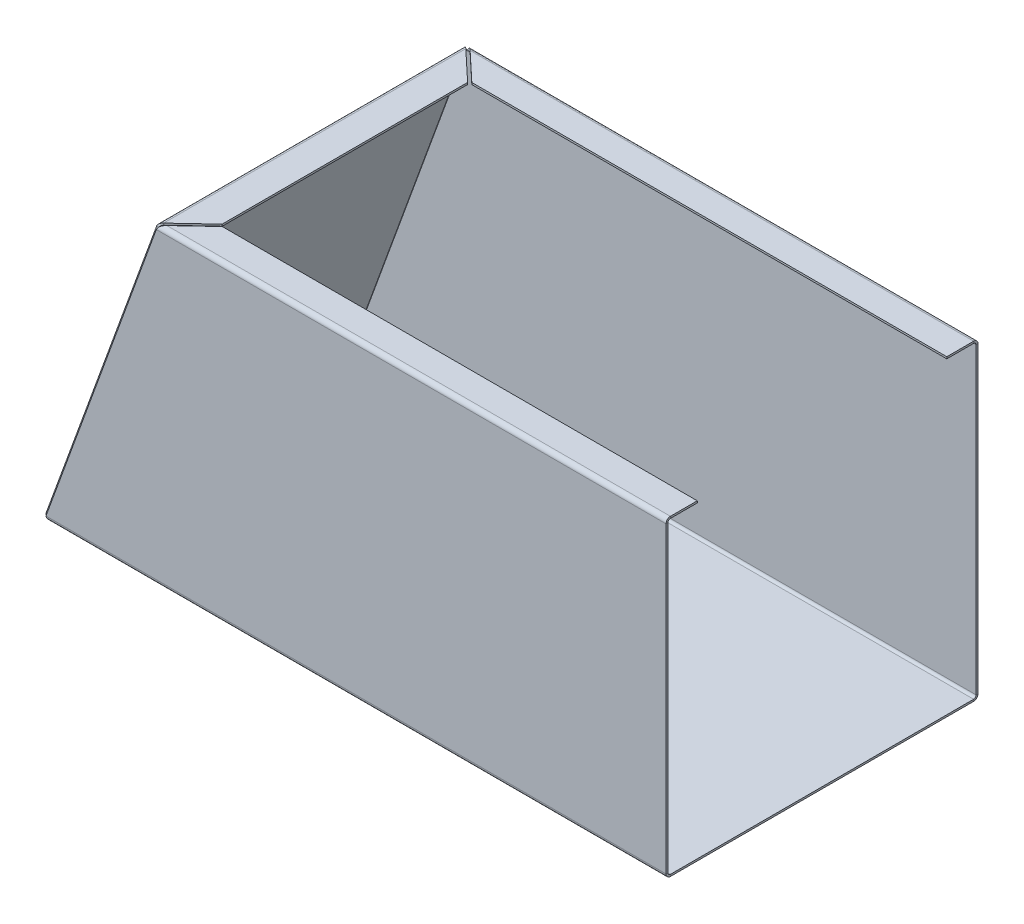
ISO-10303-21;
HEADER;
FILE_DESCRIPTION(('STEP AP214'),'2;1');
FILE_NAME('part.step','',(''),(''),'','','');
FILE_SCHEMA(('AUTOMOTIVE_DESIGN { 1 0 10303 214 1 1 1 1 }'));
ENDSEC;
DATA;
#1=APPLICATION_CONTEXT('core data for automotive mechanical design processes');
#2=APPLICATION_PROTOCOL_DEFINITION('international standard','automotive_design',2000,#1);
#3=PRODUCT_CONTEXT('',#1,'mechanical');
#4=PRODUCT('Part','Part','',(#3));
#5=PRODUCT_RELATED_PRODUCT_CATEGORY('part','',(#4));
#6=PRODUCT_DEFINITION_FORMATION('','',#4);
#7=PRODUCT_DEFINITION_CONTEXT('part definition',#1,'design');
#8=PRODUCT_DEFINITION('design','',#6,#7);
#9=PRODUCT_DEFINITION_SHAPE('','',#8);
#10=(LENGTH_UNIT() NAMED_UNIT(*) SI_UNIT(.MILLI.,.METRE.));
#11=(NAMED_UNIT(*) PLANE_ANGLE_UNIT() SI_UNIT($,.RADIAN.));
#12=(NAMED_UNIT(*) SI_UNIT($,.STERADIAN.) SOLID_ANGLE_UNIT());
#13=UNCERTAINTY_MEASURE_WITH_UNIT(LENGTH_MEASURE(1.E-05),#10,'distance_accuracy_value','');
#14=(GEOMETRIC_REPRESENTATION_CONTEXT(3) GLOBAL_UNCERTAINTY_ASSIGNED_CONTEXT((#13)) GLOBAL_UNIT_ASSIGNED_CONTEXT((#10,
#11,#12)) REPRESENTATION_CONTEXT('',''));
#15=CARTESIAN_POINT('',(0.,0.,0.));
#16=DIRECTION('',(0.,0.,1.));
#17=DIRECTION('',(1.,0.,0.));
#18=AXIS2_PLACEMENT_3D('',#15,#16,#17);
#19=CARTESIAN_POINT('',(6.93875173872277,3.5,-118.));
#20=CARTESIAN_POINT('',(6.93875173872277,3.5,-118.5));
#21=CARTESIAN_POINT('',(6.93875173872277,3.5,-119.));
#22=CARTESIAN_POINT('',(6.93875173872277,3.5,-119.5));
#23=CARTESIAN_POINT('',(6.93875173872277,-3.5,-118.));
#24=CARTESIAN_POINT('',(6.93875173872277,-2.5,-118.5));
#25=CARTESIAN_POINT('',(6.93875173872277,-1.5,-119.));
#26=CARTESIAN_POINT('',(6.93875173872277,-0.499999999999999,-119.5));
#27=CARTESIAN_POINT('',(3.058284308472,-3.5,-125.));
#28=CARTESIAN_POINT('',(3.058284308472,-2.5,-124.5));
#29=CARTESIAN_POINT('',(3.058284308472,-1.5,-124.));
#30=CARTESIAN_POINT('',(3.058284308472,-0.499999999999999,-123.5));
#31=CARTESIAN_POINT('',(3.058284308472,3.5,-125.));
#32=CARTESIAN_POINT('',(3.058284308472,3.5,-124.5));
#33=CARTESIAN_POINT('',(3.058284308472,3.5,-124.));
#34=CARTESIAN_POINT('',(3.058284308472,3.5,-123.5));
#35=CARTESIAN_POINT('',(3.058284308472,10.5,-125.));
#36=CARTESIAN_POINT('',(3.058284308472,9.5,-124.5));
#37=CARTESIAN_POINT('',(3.058284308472,8.5,-124.));
#38=CARTESIAN_POINT('',(3.058284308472,7.5,-123.5));
#39=CARTESIAN_POINT('',(6.93875173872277,10.5,-118.));
#40=CARTESIAN_POINT('',(6.93875173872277,9.5,-118.5));
#41=CARTESIAN_POINT('',(6.93875173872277,8.5,-119.));
#42=CARTESIAN_POINT('',(6.93875173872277,7.5,-119.5));
#43=CARTESIAN_POINT('',(6.93875173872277,3.5,-118.));
#44=CARTESIAN_POINT('',(6.93875173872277,3.5,-118.5));
#45=CARTESIAN_POINT('',(6.93875173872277,3.5,-119.));
#46=CARTESIAN_POINT('',(6.93875173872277,3.5,-119.5));
#47=(BOUNDED_SURFACE() B_SPLINE_SURFACE(3,3,((#19,#20,#21,#22),(#23,#24,#25,#26),(#27,#28,#29,
#30),(#31,#32,#33,#34),(#35,#36,#37,#38),(#39,#40,#41,#42),(#43,#44,#45,#46)),.UNSPECIFIED.,.T.,
.F.,.F.) B_SPLINE_SURFACE_WITH_KNOTS((4,3,4),(4,4),(0.,0.5,1.),(0.,1.),
.UNSPECIFIED.) GEOMETRIC_REPRESENTATION_ITEM() RATIONAL_B_SPLINE_SURFACE(((1.,1.,1.,1.),
(0.333333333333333,0.333333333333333,0.333333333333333,0.333333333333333),(0.333333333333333,
0.333333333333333,0.333333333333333,0.333333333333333),(1.,1.,1.,1.),(0.333333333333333,
0.333333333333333,0.333333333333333,0.333333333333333),(0.333333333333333,0.333333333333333,
0.333333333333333,0.333333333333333),(1.,1.,1.,1.))) REPRESENTATION_ITEM('') SURFACE());
#48=DIRECTION('',(0.,-1.,0.));
#49=VECTOR('',#48,1.);
#50=CARTESIAN_POINT('',(4.99851802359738,0.,-121.5));
#51=LINE('',#50,#49);
#52=CARTESIAN_POINT('',(4.99851802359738,1.5,-121.5));
#53=VERTEX_POINT('',#52);
#54=CARTESIAN_POINT('',(4.99851802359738,0.,-121.5));
#55=VERTEX_POINT('',#54);
#56=EDGE_CURVE('E11',#53,#55,#51,.T.);
#57=CARTESIAN_POINT('',(4.99851802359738,3.5,-121.5));
#58=DIRECTION('',(-0.71774976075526,0.,0.696301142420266));
#59=DIRECTION('',(0.696301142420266,0.,0.71774976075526));
#60=AXIS2_PLACEMENT_3D('',#57,#58,#59);
#61=ELLIPSE('',#60,2.78648647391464,2.);
#62=CARTESIAN_POINT('',(3.058284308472,3.5,-123.5));
#63=VERTEX_POINT('',#62);
#64=EDGE_CURVE('E156',#53,#63,#61,.F.);
#65=DIRECTION('',(0.,0.,-1.));
#66=VECTOR('',#65,1.);
#67=CARTESIAN_POINT('',(3.058284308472,3.5,-125.));
#68=LINE('',#67,#66);
#69=CARTESIAN_POINT('',(3.058284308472,3.5,-125.));
#70=VERTEX_POINT('',#69);
#71=EDGE_CURVE('E51',#63,#70,#68,.T.);
#72=CARTESIAN_POINT('',(4.99851802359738,3.5,-121.5));
#73=DIRECTION('',(-0.874603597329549,0.,0.484838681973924));
#74=DIRECTION('',(0.484838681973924,0.,0.874603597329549));
#75=AXIS2_PLACEMENT_3D('',#72,#73,#74);
#76=ELLIPSE('',#75,4.00181294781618,3.5);
#77=EDGE_CURVE('E159',#55,#70,#76,.F.);
#78=ORIENTED_EDGE('',*,*,#56,.F.);
#79=ORIENTED_EDGE('',*,*,#64,.T.);
#80=ORIENTED_EDGE('',*,*,#71,.T.);
#81=ORIENTED_EDGE('',*,*,#77,.F.);
#82=EDGE_LOOP('',(#78,#79,#80,#81));
#83=FACE_BOUND('',#82,.T.);
#84=ADVANCED_FACE('F39',(#83),#47,.F.);
#85=CARTESIAN_POINT('',(1.57565468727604,-0.573491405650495,-125.));
#86=DIRECTION('',(0.93969262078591,-0.342020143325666,0.));
#87=DIRECTION('',(0.342020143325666,0.93969262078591,0.));
#88=AXIS2_PLACEMENT_3D('',#85,#86,#87);
#89=PLANE('',#88);
#90=ORIENTED_EDGE('',*,*,#71,.F.);
#91=DIRECTION('',(0.342020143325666,0.93969262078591,0.));
#92=VECTOR('',#91,1.);
#93=CARTESIAN_POINT('',(1.57565468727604,-0.573491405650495,-123.5));
#94=LINE('',#93,#92);
#95=CARTESIAN_POINT('',(91.5030512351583,246.5,-123.5));
#96=VERTEX_POINT('',#95);
#97=EDGE_CURVE('E214',#63,#96,#94,.T.);
#98=ORIENTED_EDGE('',*,*,#97,.T.);
#99=CARTESIAN_POINT('',(91.5030512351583,246.5,-125.));
#100=CARTESIAN_POINT('',(91.5030512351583,246.5,-123.5));
#101=B_SPLINE_CURVE_WITH_KNOTS('',1,(#99,#100),.UNSPECIFIED.,.F.,.F.,(2,2),(0.,1.),.UNSPECIFIED.);
#102=CARTESIAN_POINT('',(91.5030512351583,246.5,-125.));
#103=VERTEX_POINT('',#102);
#104=EDGE_CURVE('E544',#96,#103,#101,.F.);
#105=ORIENTED_EDGE('',*,*,#104,.T.);
#106=DIRECTION('',(0.342020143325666,0.93969262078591,0.));
#107=VECTOR('',#106,1.);
#108=CARTESIAN_POINT('',(1.57565468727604,-0.573491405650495,-125.));
#109=LINE('',#108,#107);
#110=EDGE_CURVE('E746',#70,#103,#109,.T.);
#111=ORIENTED_EDGE('',*,*,#110,.F.);
#112=EDGE_LOOP('',(#90,#98,#105,#111));
#113=FACE_BOUND('',#112,.T.);
#114=ADVANCED_FACE('F507',(#113),#89,.F.);
#115=CARTESIAN_POINT('',(96.4632025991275,250.,-121.5));
#116=CARTESIAN_POINT('',(96.0377645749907,250.,-121.899780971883));
#117=CARTESIAN_POINT('',(95.5648060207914,249.931411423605,-122.306788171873));
#118=CARTESIAN_POINT('',(94.6000242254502,249.644082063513,-123.093812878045));
#119=CARTESIAN_POINT('',(94.108094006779,249.424923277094,-123.474180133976));
#120=CARTESIAN_POINT('',(93.1806894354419,248.830298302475,-124.149957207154));
#121=CARTESIAN_POINT('',(92.7452150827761,248.454068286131,-124.44533580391));
#122=CARTESIAN_POINT('',(92.0062567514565,247.563790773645,-124.87071729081));
#123=CARTESIAN_POINT('',(91.7031152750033,247.049671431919,-125.));
#124=CARTESIAN_POINT('',(91.5030512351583,246.5,-125.));
#125=CARTESIAN_POINT('',(96.4632025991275,248.5,-121.5));
#126=CARTESIAN_POINT('',(96.0377086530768,248.5,-121.728476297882));
#127=CARTESIAN_POINT('',(95.5648060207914,248.460806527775,-121.961021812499));
#128=CARTESIAN_POINT('',(94.6000242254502,248.296618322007,-122.410750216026));
#129=CARTESIAN_POINT('',(94.108094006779,248.171384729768,-122.6281029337));
#130=CARTESIAN_POINT('',(93.1806894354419,247.831599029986,-123.014261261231));
#131=CARTESIAN_POINT('',(92.7452150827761,247.616610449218,-123.183049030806));
#132=CARTESIAN_POINT('',(92.0062567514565,247.107880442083,-123.426124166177));
#133=CARTESIAN_POINT('',(91.7030487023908,246.813993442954,-123.5));
#134=CARTESIAN_POINT('',(91.5030512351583,246.5,-123.5));
#135=B_SPLINE_SURFACE_WITH_KNOTS('',1,3,((#115,#116,#117,#118,#119,#120,#121,#122,#123,#124),
(#125,#126,#127,#128,#129,#130,#131,#132,#133,#134)),.UNSPECIFIED.,.F.,.F.,.F.,(2,2),(4,2,2,2,
4),(0.,1.),(0.,0.25,0.5,0.75,1.),.UNSPECIFIED.);
#136=CARTESIAN_POINT('',(91.5030512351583,246.5,-123.5));
#137=CARTESIAN_POINT('',(91.7030487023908,246.813993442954,-123.5));
#138=CARTESIAN_POINT('',(92.0062567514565,247.107880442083,-123.426124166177));
#139=CARTESIAN_POINT('',(92.7452150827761,247.616610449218,-123.183049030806));
#140=CARTESIAN_POINT('',(93.1806894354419,247.831599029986,-123.014261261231));
#141=CARTESIAN_POINT('',(94.108094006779,248.171384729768,-122.6281029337));
#142=CARTESIAN_POINT('',(94.6000242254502,248.296618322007,-122.410750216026));
#143=CARTESIAN_POINT('',(95.5648060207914,248.460806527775,-121.961021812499));
#144=CARTESIAN_POINT('',(96.0377086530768,248.5,-121.728476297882));
#145=CARTESIAN_POINT('',(96.4632025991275,248.5,-121.5));
#146=B_SPLINE_CURVE_WITH_KNOTS('',3,(#136,#137,#138,#139,#140,#141,#142,#143,#144,#145),
.UNSPECIFIED.,.F.,.F.,(4,2,2,2,4),(0.,0.25,0.5,0.75,1.),.UNSPECIFIED.);
#147=CARTESIAN_POINT('',(96.4632025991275,248.5,-121.5));
#148=VERTEX_POINT('',#147);
#149=EDGE_CURVE('E906',#96,#148,#146,.T.);
#150=CARTESIAN_POINT('',(96.4632025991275,248.5,-121.5));
#151=CARTESIAN_POINT('',(96.4632025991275,250.,-121.5));
#152=B_SPLINE_CURVE_WITH_KNOTS('',1,(#150,#151),.UNSPECIFIED.,.F.,.F.,(2,2),(0.,1.),.UNSPECIFIED.);
#153=CARTESIAN_POINT('',(96.4632025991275,250.,-121.5));
#154=VERTEX_POINT('',#153);
#155=EDGE_CURVE('E555',#148,#154,#152,.T.);
#156=CARTESIAN_POINT('',(96.4632025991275,250.,-121.5));
#157=CARTESIAN_POINT('',(96.0377645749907,250.,-121.899780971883));
#158=CARTESIAN_POINT('',(95.5648060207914,249.931411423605,-122.306788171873));
#159=CARTESIAN_POINT('',(94.6000242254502,249.644082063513,-123.093812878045));
#160=CARTESIAN_POINT('',(94.108094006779,249.424923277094,-123.474180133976));
#161=CARTESIAN_POINT('',(93.1806894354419,248.830298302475,-124.149957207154));
#162=CARTESIAN_POINT('',(92.7452150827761,248.454068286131,-124.44533580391));
#163=CARTESIAN_POINT('',(92.0062567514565,247.563790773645,-124.87071729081));
#164=CARTESIAN_POINT('',(91.7031152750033,247.049671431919,-125.));
#165=CARTESIAN_POINT('',(91.5030512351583,246.5,-125.));
#166=B_SPLINE_CURVE_WITH_KNOTS('',3,(#156,#157,#158,#159,#160,#161,#162,#163,#164,#165),
.UNSPECIFIED.,.F.,.F.,(4,2,2,2,4),(0.,0.25,0.5,0.75,1.),.UNSPECIFIED.);
#167=EDGE_CURVE('E729',#103,#154,#166,.F.);
#168=ORIENTED_EDGE('',*,*,#104,.F.);
#169=ORIENTED_EDGE('',*,*,#149,.T.);
#170=ORIENTED_EDGE('',*,*,#155,.T.);
#171=ORIENTED_EDGE('',*,*,#167,.F.);
#172=EDGE_LOOP('',(#168,#169,#170,#171));
#173=FACE_BOUND('',#172,.T.);
#174=ADVANCED_FACE('F512',(#173),#135,.F.);
#175=CARTESIAN_POINT('',(216.569903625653,250.,-8.63661933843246));
#176=DIRECTION('',(0.684791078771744,0.,-0.728739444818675));
#177=DIRECTION('',(0.728739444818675,0.,0.684791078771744));
#178=AXIS2_PLACEMENT_3D('',#175,#176,#177);
#179=PLANE('',#178);
#180=ORIENTED_EDGE('',*,*,#155,.F.);
#181=DIRECTION('',(0.728739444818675,0.,0.684791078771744));
#182=VECTOR('',#181,1.);
#183=CARTESIAN_POINT('',(216.569903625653,248.5,-8.63661933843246));
#184=LINE('',#183,#182);
#185=CARTESIAN_POINT('',(119.343024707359,248.5,-100.));
#186=VERTEX_POINT('',#185);
#187=EDGE_CURVE('E322',#148,#186,#184,.T.);
#188=ORIENTED_EDGE('',*,*,#187,.T.);
#189=DIRECTION('',(0.,1.,0.));
#190=VECTOR('',#189,1.);
#191=CARTESIAN_POINT('',(119.343024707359,250.,-100.));
#192=LINE('',#191,#190);
#193=CARTESIAN_POINT('',(119.343024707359,250.,-100.));
#194=VERTEX_POINT('',#193);
#195=EDGE_CURVE('E561',#186,#194,#192,.T.);
#196=ORIENTED_EDGE('',*,*,#195,.T.);
#197=DIRECTION('',(0.728739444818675,0.,0.684791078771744));
#198=VECTOR('',#197,1.);
#199=CARTESIAN_POINT('',(216.569903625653,250.,-8.63661933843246));
#200=LINE('',#199,#198);
#201=EDGE_CURVE('E753',#154,#194,#200,.T.);
#202=ORIENTED_EDGE('',*,*,#201,.F.);
#203=EDGE_LOOP('',(#180,#188,#196,#202));
#204=FACE_BOUND('',#203,.T.);
#205=ADVANCED_FACE('F589',(#204),#179,.F.);
#206=CARTESIAN_POINT('',(90.9925585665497,250.,-100.));
#207=DIRECTION('',(0.,0.,1.));
#208=DIRECTION('',(-1.,0.,0.));
#209=AXIS2_PLACEMENT_3D('',#206,#207,#208);
#210=PLANE('',#209);
#211=ORIENTED_EDGE('',*,*,#195,.F.);
#212=DIRECTION('',(1.,0.,0.));
#213=VECTOR('',#212,1.);
#214=CARTESIAN_POINT('',(90.9925585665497,248.5,-100.));
#215=LINE('',#214,#213);
#216=CARTESIAN_POINT('',(500.,248.5,-100.));
#217=VERTEX_POINT('',#216);
#218=EDGE_CURVE('E877',#217,#186,#215,.F.);
#219=ORIENTED_EDGE('',*,*,#218,.F.);
#220=DIRECTION('',(0.,1.,0.));
#221=VECTOR('',#220,1.);
#222=CARTESIAN_POINT('',(500.,250.,-100.));
#223=LINE('',#222,#221);
#224=CARTESIAN_POINT('',(500.,250.,-100.));
#225=VERTEX_POINT('',#224);
#226=EDGE_CURVE('E566',#217,#225,#223,.T.);
#227=ORIENTED_EDGE('',*,*,#226,.T.);
#228=DIRECTION('',(-1.,0.,0.));
#229=VECTOR('',#228,1.);
#230=CARTESIAN_POINT('',(90.9925585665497,250.,-100.));
#231=LINE('',#230,#229);
#232=EDGE_CURVE('E719',#225,#194,#231,.T.);
#233=ORIENTED_EDGE('',*,*,#232,.T.);
#234=EDGE_LOOP('',(#211,#219,#227,#233));
#235=FACE_BOUND('',#234,.T.);
#236=ADVANCED_FACE('F598',(#235),#210,.T.);
#237=CARTESIAN_POINT('',(500.,250.,125.));
#238=DIRECTION('',(-1.,0.,0.));
#239=DIRECTION('',(0.,0.,-1.));
#240=AXIS2_PLACEMENT_3D('',#237,#238,#239);
#241=PLANE('',#240);
#242=ORIENTED_EDGE('',*,*,#226,.F.);
#243=DIRECTION('',(0.,0.,-1.));
#244=VECTOR('',#243,1.);
#245=CARTESIAN_POINT('',(500.,248.5,125.));
#246=LINE('',#245,#244);
#247=CARTESIAN_POINT('',(500.,248.5,-121.5));
#248=VERTEX_POINT('',#247);
#249=EDGE_CURVE('E215',#217,#248,#246,.T.);
#250=ORIENTED_EDGE('',*,*,#249,.T.);
#251=DIRECTION('',(0.,1.,0.));
#252=VECTOR('',#251,1.);
#253=CARTESIAN_POINT('',(500.,250.,-121.5));
#254=LINE('',#253,#252);
#255=CARTESIAN_POINT('',(500.,250.,-121.5));
#256=VERTEX_POINT('',#255);
#257=EDGE_CURVE('E574',#248,#256,#254,.T.);
#258=ORIENTED_EDGE('',*,*,#257,.T.);
#259=DIRECTION('',(0.,0.,-1.));
#260=VECTOR('',#259,1.);
#261=CARTESIAN_POINT('',(500.,250.,125.));
#262=LINE('',#261,#260);
#263=EDGE_CURVE('E708',#225,#256,#262,.T.);
#264=ORIENTED_EDGE('',*,*,#263,.F.);
#265=EDGE_LOOP('',(#242,#250,#258,#264));
#266=FACE_BOUND('',#265,.T.);
#267=ADVANCED_FACE('F601',(#266),#241,.F.);
#268=CARTESIAN_POINT('',(500.,246.5,-121.5));
#269=DIRECTION('',(1.,0.,0.));
#270=DIRECTION('',(0.,0.,-1.));
#271=AXIS2_PLACEMENT_3D('',#268,#269,#270);
#272=PLANE('',#271);
#273=ORIENTED_EDGE('',*,*,#257,.F.);
#274=CARTESIAN_POINT('',(500.,246.5,-121.5));
#275=DIRECTION('',(-1.,0.,0.));
#276=DIRECTION('',(0.,0.,1.));
#277=AXIS2_PLACEMENT_3D('',#274,#275,#276);
#278=CIRCLE('',#277,2.);
#279=CARTESIAN_POINT('',(500.,246.5,-123.5));
#280=VERTEX_POINT('',#279);
#281=EDGE_CURVE('E898',#248,#280,#278,.T.);
#282=ORIENTED_EDGE('',*,*,#281,.T.);
#283=DIRECTION('',(0.,0.,-1.));
#284=VECTOR('',#283,1.);
#285=CARTESIAN_POINT('',(500.,246.5,-125.));
#286=LINE('',#285,#284);
#287=CARTESIAN_POINT('',(500.,246.5,-125.));
#288=VERTEX_POINT('',#287);
#289=EDGE_CURVE('E699',#280,#288,#286,.T.);
#290=ORIENTED_EDGE('',*,*,#289,.T.);
#291=CARTESIAN_POINT('',(500.,246.5,-121.5));
#292=DIRECTION('',(-1.,0.,0.));
#293=DIRECTION('',(0.,0.,1.));
#294=AXIS2_PLACEMENT_3D('',#291,#292,#293);
#295=CIRCLE('',#294,3.5);
#296=EDGE_CURVE('E723',#256,#288,#295,.T.);
#297=ORIENTED_EDGE('',*,*,#296,.F.);
#298=EDGE_LOOP('',(#273,#282,#290,#297));
#299=FACE_BOUND('',#298,.T.);
#300=ADVANCED_FACE('F603',(#299),#272,.T.);
#301=CARTESIAN_POINT('',(500.,0.,-125.));
#302=DIRECTION('',(1.,0.,0.));
#303=DIRECTION('',(0.,1.,0.));
#304=AXIS2_PLACEMENT_3D('',#301,#302,#303);
#305=PLANE('',#304);
#306=ORIENTED_EDGE('',*,*,#289,.F.);
#307=DIRECTION('',(0.,1.,0.));
#308=VECTOR('',#307,1.);
#309=CARTESIAN_POINT('',(500.,0.,-123.5));
#310=LINE('',#309,#308);
#311=CARTESIAN_POINT('',(500.,3.5,-123.5));
#312=VERTEX_POINT('',#311);
#313=EDGE_CURVE('E888',#312,#280,#310,.T.);
#314=ORIENTED_EDGE('',*,*,#313,.F.);
#315=DIRECTION('',(0.,0.,-1.));
#316=VECTOR('',#315,1.);
#317=CARTESIAN_POINT('',(500.,3.5,-125.));
#318=LINE('',#317,#316);
#319=CARTESIAN_POINT('',(500.,3.5,-125.));
#320=VERTEX_POINT('',#319);
#321=EDGE_CURVE('E696',#312,#320,#318,.T.);
#322=ORIENTED_EDGE('',*,*,#321,.T.);
#323=DIRECTION('',(0.,1.,0.));
#324=VECTOR('',#323,1.);
#325=CARTESIAN_POINT('',(500.,0.,-125.));
#326=LINE('',#325,#324);
#327=EDGE_CURVE('E838',#320,#288,#326,.T.);
#328=ORIENTED_EDGE('',*,*,#327,.T.);
#329=EDGE_LOOP('',(#306,#314,#322,#328));
#330=FACE_BOUND('',#329,.T.);
#331=ADVANCED_FACE('F606',(#330),#305,.T.);
#332=CARTESIAN_POINT('',(500.,3.5,-121.5));
#333=DIRECTION('',(-1.,0.,0.));
#334=DIRECTION('',(0.,0.,1.));
#335=AXIS2_PLACEMENT_3D('',#332,#333,#334);
#336=PLANE('',#335);
#337=ORIENTED_EDGE('',*,*,#321,.F.);
#338=CARTESIAN_POINT('',(500.,3.5,-121.5));
#339=DIRECTION('',(1.,0.,0.));
#340=DIRECTION('',(0.,0.,-1.));
#341=AXIS2_PLACEMENT_3D('',#338,#339,#340);
#342=CIRCLE('',#341,2.);
#343=CARTESIAN_POINT('',(500.,1.5,-121.5));
#344=VERTEX_POINT('',#343);
#345=EDGE_CURVE('E873',#312,#344,#342,.F.);
#346=ORIENTED_EDGE('',*,*,#345,.T.);
#347=DIRECTION('',(0.,-1.,0.));
#348=VECTOR('',#347,1.);
#349=CARTESIAN_POINT('',(500.,0.,-121.5));
#350=LINE('',#349,#348);
#351=CARTESIAN_POINT('',(500.,0.,-121.5));
#352=VERTEX_POINT('',#351);
#353=EDGE_CURVE('E693',#344,#352,#350,.T.);
#354=ORIENTED_EDGE('',*,*,#353,.T.);
#355=CARTESIAN_POINT('',(500.,3.5,-121.5));
#356=DIRECTION('',(1.,0.,0.));
#357=DIRECTION('',(0.,0.,-1.));
#358=AXIS2_PLACEMENT_3D('',#355,#356,#357);
#359=CIRCLE('',#358,3.5);
#360=EDGE_CURVE('E983',#320,#352,#359,.F.);
#361=ORIENTED_EDGE('',*,*,#360,.F.);
#362=EDGE_LOOP('',(#337,#346,#354,#361));
#363=FACE_BOUND('',#362,.T.);
#364=ADVANCED_FACE('F610',(#363),#336,.F.);
#365=CARTESIAN_POINT('',(500.,0.,125.));
#366=DIRECTION('',(1.,0.,0.));
#367=DIRECTION('',(0.,0.,-1.));
#368=AXIS2_PLACEMENT_3D('',#365,#366,#367);
#369=PLANE('',#368);
#370=ORIENTED_EDGE('',*,*,#353,.F.);
#371=DIRECTION('',(0.,0.,1.));
#372=VECTOR('',#371,1.);
#373=CARTESIAN_POINT('',(500.,1.5,125.));
#374=LINE('',#373,#372);
#375=CARTESIAN_POINT('',(500.,1.5,121.5));
#376=VERTEX_POINT('',#375);
#377=EDGE_CURVE('E175',#376,#344,#374,.F.);
#378=ORIENTED_EDGE('',*,*,#377,.F.);
#379=DIRECTION('',(0.,-1.,0.));
#380=VECTOR('',#379,1.);
#381=CARTESIAN_POINT('',(500.,0.,121.5));
#382=LINE('',#381,#380);
#383=CARTESIAN_POINT('',(500.,0.,121.5));
#384=VERTEX_POINT('',#383);
#385=EDGE_CURVE('E690',#376,#384,#382,.T.);
#386=ORIENTED_EDGE('',*,*,#385,.T.);
#387=DIRECTION('',(0.,0.,-1.));
#388=VECTOR('',#387,1.);
#389=CARTESIAN_POINT('',(500.,0.,125.));
#390=LINE('',#389,#388);
#391=EDGE_CURVE('E827',#384,#352,#390,.T.);
#392=ORIENTED_EDGE('',*,*,#391,.T.);
#393=EDGE_LOOP('',(#370,#378,#386,#392));
#394=FACE_BOUND('',#393,.T.);
#395=ADVANCED_FACE('F614',(#394),#369,.T.);
#396=CARTESIAN_POINT('',(500.,3.5,121.5));
#397=DIRECTION('',(1.,0.,0.));
#398=DIRECTION('',(0.,0.,-1.));
#399=AXIS2_PLACEMENT_3D('',#396,#397,#398);
#400=PLANE('',#399);
#401=ORIENTED_EDGE('',*,*,#385,.F.);
#402=CARTESIAN_POINT('',(500.,3.5,121.5));
#403=DIRECTION('',(-1.,0.,0.));
#404=DIRECTION('',(0.,0.,1.));
#405=AXIS2_PLACEMENT_3D('',#402,#403,#404);
#406=CIRCLE('',#405,2.);
#407=CARTESIAN_POINT('',(500.,3.5,123.5));
#408=VERTEX_POINT('',#407);
#409=EDGE_CURVE('E899',#376,#408,#406,.T.);
#410=ORIENTED_EDGE('',*,*,#409,.T.);
#411=DIRECTION('',(0.,0.,1.));
#412=VECTOR('',#411,1.);
#413=CARTESIAN_POINT('',(500.,3.5,125.));
#414=LINE('',#413,#412);
#415=CARTESIAN_POINT('',(500.,3.5,125.));
#416=VERTEX_POINT('',#415);
#417=EDGE_CURVE('E687',#408,#416,#414,.T.);
#418=ORIENTED_EDGE('',*,*,#417,.T.);
#419=CARTESIAN_POINT('',(500.,3.5,121.5));
#420=DIRECTION('',(-1.,0.,0.));
#421=DIRECTION('',(0.,0.,1.));
#422=AXIS2_PLACEMENT_3D('',#419,#420,#421);
#423=CIRCLE('',#422,3.5);
#424=EDGE_CURVE('E198',#384,#416,#423,.T.);
#425=ORIENTED_EDGE('',*,*,#424,.F.);
#426=EDGE_LOOP('',(#401,#410,#418,#425));
#427=FACE_BOUND('',#426,.T.);
#428=ADVANCED_FACE('F618',(#427),#400,.T.);
#429=CARTESIAN_POINT('',(500.,0.,125.));
#430=DIRECTION('',(1.,0.,0.));
#431=DIRECTION('',(0.,1.,0.));
#432=AXIS2_PLACEMENT_3D('',#429,#430,#431);
#433=PLANE('',#432);
#434=ORIENTED_EDGE('',*,*,#417,.F.);
#435=DIRECTION('',(0.,1.,0.));
#436=VECTOR('',#435,1.);
#437=CARTESIAN_POINT('',(500.,0.,123.5));
#438=LINE('',#437,#436);
#439=CARTESIAN_POINT('',(500.,246.5,123.5));
#440=VERTEX_POINT('',#439);
#441=EDGE_CURVE('E895',#408,#440,#438,.T.);
#442=ORIENTED_EDGE('',*,*,#441,.T.);
#443=DIRECTION('',(0.,0.,1.));
#444=VECTOR('',#443,1.);
#445=CARTESIAN_POINT('',(500.,246.5,125.));
#446=LINE('',#445,#444);
#447=CARTESIAN_POINT('',(500.,246.5,125.));
#448=VERTEX_POINT('',#447);
#449=EDGE_CURVE('E684',#440,#448,#446,.T.);
#450=ORIENTED_EDGE('',*,*,#449,.T.);
#451=DIRECTION('',(0.,1.,0.));
#452=VECTOR('',#451,1.);
#453=CARTESIAN_POINT('',(500.,0.,125.));
#454=LINE('',#453,#452);
#455=EDGE_CURVE('E728',#416,#448,#454,.T.);
#456=ORIENTED_EDGE('',*,*,#455,.F.);
#457=EDGE_LOOP('',(#434,#442,#450,#456));
#458=FACE_BOUND('',#457,.T.);
#459=ADVANCED_FACE('F622',(#458),#433,.T.);
#460=CARTESIAN_POINT('',(500.,246.5,121.5));
#461=DIRECTION('',(-1.,0.,0.));
#462=DIRECTION('',(0.,0.,1.));
#463=AXIS2_PLACEMENT_3D('',#460,#461,#462);
#464=PLANE('',#463);
#465=ORIENTED_EDGE('',*,*,#449,.F.);
#466=CARTESIAN_POINT('',(500.,246.5,121.5));
#467=DIRECTION('',(1.,0.,0.));
#468=DIRECTION('',(0.,0.,-1.));
#469=AXIS2_PLACEMENT_3D('',#466,#467,#468);
#470=CIRCLE('',#469,2.);
#471=CARTESIAN_POINT('',(500.,248.5,121.5));
#472=VERTEX_POINT('',#471);
#473=EDGE_CURVE('E891',#440,#472,#470,.F.);
#474=ORIENTED_EDGE('',*,*,#473,.T.);
#475=DIRECTION('',(0.,1.,0.));
#476=VECTOR('',#475,1.);
#477=CARTESIAN_POINT('',(500.,250.,121.5));
#478=LINE('',#477,#476);
#479=CARTESIAN_POINT('',(500.,250.,121.5));
#480=VERTEX_POINT('',#479);
#481=EDGE_CURVE('E681',#472,#480,#478,.T.);
#482=ORIENTED_EDGE('',*,*,#481,.T.);
#483=CARTESIAN_POINT('',(500.,246.5,121.5));
#484=DIRECTION('',(1.,0.,0.));
#485=DIRECTION('',(0.,0.,-1.));
#486=AXIS2_PLACEMENT_3D('',#483,#484,#485);
#487=CIRCLE('',#486,3.5);
#488=EDGE_CURVE('E986',#448,#480,#487,.F.);
#489=ORIENTED_EDGE('',*,*,#488,.F.);
#490=EDGE_LOOP('',(#465,#474,#482,#489));
#491=FACE_BOUND('',#490,.T.);
#492=ADVANCED_FACE('F626',(#491),#464,.F.);
#493=ORIENTED_EDGE('',*,*,#481,.F.);
#494=DIRECTION('',(0.,0.,-1.));
#495=VECTOR('',#494,1.);
#496=CARTESIAN_POINT('',(500.,248.5,125.));
#497=LINE('',#496,#495);
#498=CARTESIAN_POINT('',(500.,248.5,100.));
#499=VERTEX_POINT('',#498);
#500=EDGE_CURVE('E878',#472,#499,#497,.T.);
#501=ORIENTED_EDGE('',*,*,#500,.T.);
#502=DIRECTION('',(0.,1.,0.));
#503=VECTOR('',#502,1.);
#504=CARTESIAN_POINT('',(500.,250.,100.));
#505=LINE('',#504,#503);
#506=CARTESIAN_POINT('',(500.,250.,100.));
#507=VERTEX_POINT('',#506);
#508=EDGE_CURVE('E678',#499,#507,#505,.T.);
#509=ORIENTED_EDGE('',*,*,#508,.T.);
#510=EDGE_CURVE('E721',#480,#507,#262,.T.);
#511=ORIENTED_EDGE('',*,*,#510,.F.);
#512=EDGE_LOOP('',(#493,#501,#509,#511));
#513=FACE_BOUND('',#512,.T.);
#514=ADVANCED_FACE('F630',(#513),#241,.F.);
#515=CARTESIAN_POINT('',(90.9925585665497,250.,100.));
#516=DIRECTION('',(0.,0.,1.));
#517=DIRECTION('',(-1.,0.,0.));
#518=AXIS2_PLACEMENT_3D('',#515,#516,#517);
#519=PLANE('',#518);
#520=ORIENTED_EDGE('',*,*,#508,.F.);
#521=DIRECTION('',(1.,0.,0.));
#522=VECTOR('',#521,1.);
#523=CARTESIAN_POINT('',(90.9925585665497,248.5,100.));
#524=LINE('',#523,#522);
#525=CARTESIAN_POINT('',(119.34302470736,248.5,100.));
#526=VERTEX_POINT('',#525);
#527=EDGE_CURVE('E885',#499,#526,#524,.F.);
#528=ORIENTED_EDGE('',*,*,#527,.T.);
#529=DIRECTION('',(0.,1.,0.));
#530=VECTOR('',#529,1.);
#531=CARTESIAN_POINT('',(119.34302470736,250.,100.));
#532=LINE('',#531,#530);
#533=CARTESIAN_POINT('',(119.34302470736,250.,100.));
#534=VERTEX_POINT('',#533);
#535=EDGE_CURVE('E670',#526,#534,#532,.T.);
#536=ORIENTED_EDGE('',*,*,#535,.T.);
#537=DIRECTION('',(-1.,0.,0.));
#538=VECTOR('',#537,1.);
#539=CARTESIAN_POINT('',(90.9925585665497,250.,100.));
#540=LINE('',#539,#538);
#541=EDGE_CURVE('E996',#507,#534,#540,.T.);
#542=ORIENTED_EDGE('',*,*,#541,.F.);
#543=EDGE_LOOP('',(#520,#528,#536,#542));
#544=FACE_BOUND('',#543,.T.);
#545=ADVANCED_FACE('F634',(#544),#519,.F.);
#546=CARTESIAN_POINT('',(91.8113359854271,250.,125.871324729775));
#547=DIRECTION('',(0.684791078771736,0.,0.728739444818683));
#548=DIRECTION('',(-0.728739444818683,0.,0.684791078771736));
#549=AXIS2_PLACEMENT_3D('',#546,#547,#548);
#550=PLANE('',#549);
#551=ORIENTED_EDGE('',*,*,#535,.F.);
#552=DIRECTION('',(-0.728739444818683,0.,0.684791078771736));
#553=VECTOR('',#552,1.);
#554=CARTESIAN_POINT('',(91.8113359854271,248.5,125.871324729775));
#555=LINE('',#554,#553);
#556=CARTESIAN_POINT('',(96.4632025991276,248.5,121.5));
#557=VERTEX_POINT('',#556);
#558=EDGE_CURVE('E912',#526,#557,#555,.T.);
#559=ORIENTED_EDGE('',*,*,#558,.T.);
#560=CARTESIAN_POINT('',(96.4632025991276,250.,121.5));
#561=CARTESIAN_POINT('',(96.4632025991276,248.5,121.5));
#562=B_SPLINE_CURVE_WITH_KNOTS('',1,(#560,#561),.UNSPECIFIED.,.F.,.F.,(2,2),(0.,1.),.UNSPECIFIED.);
#563=CARTESIAN_POINT('',(96.4632025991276,250.,121.5));
#564=VERTEX_POINT('',#563);
#565=EDGE_CURVE('E665',#557,#564,#562,.F.);
#566=ORIENTED_EDGE('',*,*,#565,.T.);
#567=DIRECTION('',(-0.728739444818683,0.,0.684791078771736));
#568=VECTOR('',#567,1.);
#569=CARTESIAN_POINT('',(91.8113359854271,250.,125.871324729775));
#570=LINE('',#569,#568);
#571=EDGE_CURVE('E738',#534,#564,#570,.T.);
#572=ORIENTED_EDGE('',*,*,#571,.F.);
#573=EDGE_LOOP('',(#551,#559,#566,#572));
#574=FACE_BOUND('',#573,.T.);
#575=ADVANCED_FACE('F638',(#574),#550,.F.);
#576=CARTESIAN_POINT('',(91.5030512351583,246.5,125.));
#577=CARTESIAN_POINT('',(91.7031152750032,247.049671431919,125.));
#578=CARTESIAN_POINT('',(92.0062567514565,247.563790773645,124.87071729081));
#579=CARTESIAN_POINT('',(92.7452150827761,248.454068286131,124.44533580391));
#580=CARTESIAN_POINT('',(93.1806894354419,248.830298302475,124.149957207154));
#581=CARTESIAN_POINT('',(94.108094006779,249.424923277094,123.474180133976));
#582=CARTESIAN_POINT('',(94.6000242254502,249.644082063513,123.093812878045));
#583=CARTESIAN_POINT('',(95.5648060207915,249.931411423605,122.306788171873));
#584=CARTESIAN_POINT('',(96.0377645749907,250.,121.899780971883));
#585=CARTESIAN_POINT('',(96.4632025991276,250.,121.5));
#586=CARTESIAN_POINT('',(91.5030512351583,246.5,123.5));
#587=CARTESIAN_POINT('',(91.7030487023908,246.813993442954,123.5));
#588=CARTESIAN_POINT('',(92.0062567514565,247.107880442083,123.426124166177));
#589=CARTESIAN_POINT('',(92.7452150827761,247.616610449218,123.183049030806));
#590=CARTESIAN_POINT('',(93.1806894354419,247.831599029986,123.014261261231));
#591=CARTESIAN_POINT('',(94.108094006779,248.171384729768,122.6281029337));
#592=CARTESIAN_POINT('',(94.6000242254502,248.296618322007,122.410750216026));
#593=CARTESIAN_POINT('',(95.5648060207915,248.460806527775,121.961021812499));
#594=CARTESIAN_POINT('',(96.0377086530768,248.5,121.728476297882));
#595=CARTESIAN_POINT('',(96.4632025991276,248.5,121.5));
#596=B_SPLINE_SURFACE_WITH_KNOTS('',1,3,((#576,#577,#578,#579,#580,#581,#582,#583,#584,#585),
(#586,#587,#588,#589,#590,#591,#592,#593,#594,#595)),.UNSPECIFIED.,.F.,.F.,.F.,(2,2),(4,2,2,2,
4),(0.,1.),(0.,0.25,0.5,0.75,1.),.UNSPECIFIED.);
#597=CARTESIAN_POINT('',(96.4632025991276,248.5,121.5));
#598=CARTESIAN_POINT('',(96.0377086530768,248.5,121.728476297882));
#599=CARTESIAN_POINT('',(95.5648060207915,248.460806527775,121.961021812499));
#600=CARTESIAN_POINT('',(94.6000242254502,248.296618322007,122.410750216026));
#601=CARTESIAN_POINT('',(94.108094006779,248.171384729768,122.6281029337));
#602=CARTESIAN_POINT('',(93.1806894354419,247.831599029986,123.014261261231));
#603=CARTESIAN_POINT('',(92.7452150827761,247.616610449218,123.183049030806));
#604=CARTESIAN_POINT('',(92.0062567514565,247.107880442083,123.426124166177));
#605=CARTESIAN_POINT('',(91.7030487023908,246.813993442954,123.5));
#606=CARTESIAN_POINT('',(91.5030512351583,246.5,123.5));
#607=B_SPLINE_CURVE_WITH_KNOTS('',3,(#597,#598,#599,#600,#601,#602,#603,#604,#605,#606),
.UNSPECIFIED.,.F.,.F.,(4,2,2,2,4),(0.,0.25,0.5,0.75,1.),.UNSPECIFIED.);
#608=CARTESIAN_POINT('',(91.5030512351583,246.5,123.5));
#609=VERTEX_POINT('',#608);
#610=EDGE_CURVE('E894',#557,#609,#607,.T.);
#611=CARTESIAN_POINT('',(91.5030512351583,246.5,123.5));
#612=CARTESIAN_POINT('',(91.5030512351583,246.5,125.));
#613=B_SPLINE_CURVE_WITH_KNOTS('',1,(#611,#612),.UNSPECIFIED.,.F.,.F.,(2,2),(0.,1.),.UNSPECIFIED.);
#614=CARTESIAN_POINT('',(91.5030512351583,246.5,125.));
#615=VERTEX_POINT('',#614);
#616=EDGE_CURVE('E1036',#609,#615,#613,.T.);
#617=CARTESIAN_POINT('',(91.5030512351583,246.5,125.));
#618=CARTESIAN_POINT('',(91.7031152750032,247.049671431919,125.));
#619=CARTESIAN_POINT('',(92.0062567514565,247.563790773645,124.87071729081));
#620=CARTESIAN_POINT('',(92.7452150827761,248.454068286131,124.44533580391));
#621=CARTESIAN_POINT('',(93.1806894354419,248.830298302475,124.149957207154));
#622=CARTESIAN_POINT('',(94.108094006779,249.424923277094,123.474180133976));
#623=CARTESIAN_POINT('',(94.6000242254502,249.644082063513,123.093812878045));
#624=CARTESIAN_POINT('',(95.5648060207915,249.931411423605,122.306788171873));
#625=CARTESIAN_POINT('',(96.0377645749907,250.,121.899780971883));
#626=CARTESIAN_POINT('',(96.4632025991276,250.,121.5));
#627=B_SPLINE_CURVE_WITH_KNOTS('',3,(#617,#618,#619,#620,#621,#622,#623,#624,#625,#626),
.UNSPECIFIED.,.F.,.F.,(4,2,2,2,4),(0.,0.25,0.5,0.75,1.),.UNSPECIFIED.);
#628=EDGE_CURVE('E201',#564,#615,#627,.F.);
#629=ORIENTED_EDGE('',*,*,#565,.F.);
#630=ORIENTED_EDGE('',*,*,#610,.T.);
#631=ORIENTED_EDGE('',*,*,#616,.T.);
#632=ORIENTED_EDGE('',*,*,#628,.F.);
#633=EDGE_LOOP('',(#629,#630,#631,#632));
#634=FACE_BOUND('',#633,.T.);
#635=ADVANCED_FACE('F643',(#634),#596,.F.);
#636=CARTESIAN_POINT('',(1.57565468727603,-0.573491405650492,125.));
#637=DIRECTION('',(-0.93969262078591,0.342020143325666,0.));
#638=DIRECTION('',(-0.342020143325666,-0.93969262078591,0.));
#639=AXIS2_PLACEMENT_3D('',#636,#637,#638);
#640=PLANE('',#639);
#641=ORIENTED_EDGE('',*,*,#616,.F.);
#642=DIRECTION('',(-0.342020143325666,-0.93969262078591,0.));
#643=VECTOR('',#642,1.);
#644=CARTESIAN_POINT('',(1.57565468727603,-0.573491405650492,123.5));
#645=LINE('',#644,#643);
#646=CARTESIAN_POINT('',(3.05828430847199,3.5,123.5));
#647=VERTEX_POINT('',#646);
#648=EDGE_CURVE('E474',#609,#647,#645,.T.);
#649=ORIENTED_EDGE('',*,*,#648,.T.);
#650=DIRECTION('',(0.,0.,1.));
#651=VECTOR('',#650,1.);
#652=CARTESIAN_POINT('',(3.05828430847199,3.5,125.));
#653=LINE('',#652,#651);
#654=CARTESIAN_POINT('',(3.05828430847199,3.5,125.));
#655=VERTEX_POINT('',#654);
#656=EDGE_CURVE('E1032',#647,#655,#653,.T.);
#657=ORIENTED_EDGE('',*,*,#656,.T.);
#658=DIRECTION('',(-0.342020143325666,-0.93969262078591,0.));
#659=VECTOR('',#658,1.);
#660=CARTESIAN_POINT('',(1.57565468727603,-0.573491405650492,125.));
#661=LINE('',#660,#659);
#662=EDGE_CURVE('E271',#615,#655,#661,.T.);
#663=ORIENTED_EDGE('',*,*,#662,.F.);
#664=EDGE_LOOP('',(#641,#649,#657,#663));
#665=FACE_BOUND('',#664,.T.);
#666=ADVANCED_FACE('F1049',(#665),#640,.T.);
#667=CARTESIAN_POINT('',(3.058284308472,3.5,125.));
#668=CARTESIAN_POINT('',(3.058284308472,3.5,124.5));
#669=CARTESIAN_POINT('',(3.058284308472,3.5,124.));
#670=CARTESIAN_POINT('',(3.058284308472,3.5,123.5));
#671=CARTESIAN_POINT('',(3.058284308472,10.5,125.));
#672=CARTESIAN_POINT('',(3.058284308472,9.5,124.5));
#673=CARTESIAN_POINT('',(3.058284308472,8.5,124.));
#674=CARTESIAN_POINT('',(3.058284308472,7.5,123.5));
#675=CARTESIAN_POINT('',(6.93875173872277,10.5,118.));
#676=CARTESIAN_POINT('',(6.93875173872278,9.5,118.5));
#677=CARTESIAN_POINT('',(6.93875173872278,8.5,119.));
#678=CARTESIAN_POINT('',(6.93875173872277,7.5,119.5));
#679=CARTESIAN_POINT('',(6.93875173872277,3.5,118.));
#680=CARTESIAN_POINT('',(6.93875173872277,3.5,118.5));
#681=CARTESIAN_POINT('',(6.93875173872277,3.5,119.));
#682=CARTESIAN_POINT('',(6.93875173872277,3.5,119.5));
#683=CARTESIAN_POINT('',(6.93875173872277,-3.5,118.));
#684=CARTESIAN_POINT('',(6.93875173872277,-2.5,118.5));
#685=CARTESIAN_POINT('',(6.93875173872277,-1.5,119.));
#686=CARTESIAN_POINT('',(6.93875173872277,-0.5,119.5));
#687=CARTESIAN_POINT('',(3.058284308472,-3.5,125.));
#688=CARTESIAN_POINT('',(3.058284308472,-2.5,124.5));
#689=CARTESIAN_POINT('',(3.058284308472,-1.5,124.));
#690=CARTESIAN_POINT('',(3.058284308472,-0.499999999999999,123.5));
#691=CARTESIAN_POINT('',(3.058284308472,3.5,125.));
#692=CARTESIAN_POINT('',(3.058284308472,3.5,124.5));
#693=CARTESIAN_POINT('',(3.058284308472,3.5,124.));
#694=CARTESIAN_POINT('',(3.058284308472,3.5,123.5));
#695=(BOUNDED_SURFACE() B_SPLINE_SURFACE(3,3,((#667,#668,#669,#670),(#671,#672,#673,#674),(#675,
#676,#677,#678),(#679,#680,#681,#682),(#683,#684,#685,#686),(#687,#688,#689,#690),(#691,#692,
#693,#694)),.UNSPECIFIED.,.T.,.F.,.F.) B_SPLINE_SURFACE_WITH_KNOTS((4,3,4),(4,4),(0.,0.5,1.),
(0.,1.),.UNSPECIFIED.) GEOMETRIC_REPRESENTATION_ITEM() RATIONAL_B_SPLINE_SURFACE(((1.,1.,1.,1.),
(0.333333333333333,0.333333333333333,0.333333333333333,0.333333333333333),(0.333333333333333,
0.333333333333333,0.333333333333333,0.333333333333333),(1.,1.,1.,1.),(0.333333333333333,
0.333333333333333,0.333333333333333,0.333333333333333),(0.333333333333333,0.333333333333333,
0.333333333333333,0.333333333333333),(1.,1.,1.,1.))) REPRESENTATION_ITEM('') SURFACE());
#696=CARTESIAN_POINT('',(4.99851802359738,3.5,121.5));
#697=DIRECTION('',(0.717749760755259,0.,0.696301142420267));
#698=DIRECTION('',(-0.696301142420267,0.,0.717749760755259));
#699=AXIS2_PLACEMENT_3D('',#696,#697,#698);
#700=ELLIPSE('',#699,2.78648647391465,2.);
#701=CARTESIAN_POINT('',(4.99851802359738,1.5,121.5));
#702=VERTEX_POINT('',#701);
#703=EDGE_CURVE('E866',#702,#647,#700,.F.);
#704=DIRECTION('',(0.,-1.,0.));
#705=VECTOR('',#704,1.);
#706=CARTESIAN_POINT('',(4.99851802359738,0.,121.5));
#707=LINE('',#706,#705);
#708=CARTESIAN_POINT('',(4.99851802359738,0.,121.5));
#709=VERTEX_POINT('',#708);
#710=EDGE_CURVE('E1030',#702,#709,#707,.T.);
#711=CARTESIAN_POINT('',(4.99851802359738,3.5,121.5));
#712=DIRECTION('',(0.874603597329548,0.,0.484838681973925));
#713=DIRECTION('',(-0.484838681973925,0.,0.874603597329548));
#714=AXIS2_PLACEMENT_3D('',#711,#712,#713);
#715=ELLIPSE('',#714,4.00181294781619,3.5);
#716=EDGE_CURVE('E845',#709,#655,#715,.F.);
#717=ORIENTED_EDGE('',*,*,#656,.F.);
#718=ORIENTED_EDGE('',*,*,#703,.F.);
#719=ORIENTED_EDGE('',*,*,#710,.T.);
#720=ORIENTED_EDGE('',*,*,#716,.T.);
#721=EDGE_LOOP('',(#717,#718,#719,#720));
#722=FACE_BOUND('',#721,.T.);
#723=ADVANCED_FACE('F1058',(#722),#695,.T.);
#724=CARTESIAN_POINT('',(8.49851802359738,3.5,119.559766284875));
#725=CARTESIAN_POINT('',(7.99851802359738,3.5,119.559766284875));
#726=CARTESIAN_POINT('',(7.49851802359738,3.5,119.559766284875));
#727=CARTESIAN_POINT('',(6.99851802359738,3.5,119.559766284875));
#728=CARTESIAN_POINT('',(8.49851802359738,10.5,119.559766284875));
#729=CARTESIAN_POINT('',(7.99851802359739,9.5,119.559766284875));
#730=CARTESIAN_POINT('',(7.49851802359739,8.5,119.559766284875));
#731=CARTESIAN_POINT('',(6.99851802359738,7.5,119.559766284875));
#732=CARTESIAN_POINT('',(1.49851802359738,10.5,123.440233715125));
#733=CARTESIAN_POINT('',(1.99851802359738,9.5,123.440233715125));
#734=CARTESIAN_POINT('',(2.49851802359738,8.5,123.440233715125));
#735=CARTESIAN_POINT('',(2.99851802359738,7.5,123.440233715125));
#736=CARTESIAN_POINT('',(1.49851802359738,3.5,123.440233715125));
#737=CARTESIAN_POINT('',(1.99851802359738,3.5,123.440233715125));
#738=CARTESIAN_POINT('',(2.49851802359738,3.5,123.440233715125));
#739=CARTESIAN_POINT('',(2.99851802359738,3.5,123.440233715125));
#740=CARTESIAN_POINT('',(1.49851802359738,-3.5,123.440233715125));
#741=CARTESIAN_POINT('',(1.99851802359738,-2.5,123.440233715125));
#742=CARTESIAN_POINT('',(2.49851802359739,-1.5,123.440233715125));
#743=CARTESIAN_POINT('',(2.99851802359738,-0.5,123.440233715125));
#744=CARTESIAN_POINT('',(8.49851802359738,-3.5,119.559766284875));
#745=CARTESIAN_POINT('',(7.99851802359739,-2.5,119.559766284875));
#746=CARTESIAN_POINT('',(7.49851802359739,-1.5,119.559766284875));
#747=CARTESIAN_POINT('',(6.99851802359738,-0.499999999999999,119.559766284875));
#748=CARTESIAN_POINT('',(8.49851802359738,3.5,119.559766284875));
#749=CARTESIAN_POINT('',(7.99851802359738,3.5,119.559766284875));
#750=CARTESIAN_POINT('',(7.49851802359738,3.5,119.559766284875));
#751=CARTESIAN_POINT('',(6.99851802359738,3.5,119.559766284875));
#752=(BOUNDED_SURFACE() B_SPLINE_SURFACE(3,3,((#724,#725,#726,#727),(#728,#729,#730,#731),(#732,
#733,#734,#735),(#736,#737,#738,#739),(#740,#741,#742,#743),(#744,#745,#746,#747),(#748,#749,
#750,#751)),.UNSPECIFIED.,.T.,.F.,.F.) B_SPLINE_SURFACE_WITH_KNOTS((4,3,4),(4,4),(0.,0.5,1.),
(0.,1.),.UNSPECIFIED.) GEOMETRIC_REPRESENTATION_ITEM() RATIONAL_B_SPLINE_SURFACE(((1.,1.,1.,1.),
(0.333333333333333,0.333333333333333,0.333333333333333,0.333333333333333),(0.333333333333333,
0.333333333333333,0.333333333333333,0.333333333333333),(1.,1.,1.,1.),(0.333333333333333,
0.333333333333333,0.333333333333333,0.333333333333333),(0.333333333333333,0.333333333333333,
0.333333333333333,0.333333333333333),(1.,1.,1.,1.))) REPRESENTATION_ITEM('') SURFACE());
#753=CARTESIAN_POINT('',(4.99851802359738,3.5,121.5));
#754=DIRECTION('',(-0.696301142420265,0.,-0.717749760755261));
#755=DIRECTION('',(0.717749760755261,0.,-0.696301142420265));
#756=AXIS2_PLACEMENT_3D('',#753,#754,#755);
#757=ELLIPSE('',#756,2.78648647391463,2.);
#758=CARTESIAN_POINT('',(3.00871503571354,3.70170292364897,123.430341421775));
#759=VERTEX_POINT('',#758);
#760=EDGE_CURVE('E189',#759,#702,#757,.F.);
#761=DIRECTION('',(-0.99490149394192,0.100851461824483,0.));
#762=VECTOR('',#761,1.);
#763=CARTESIAN_POINT('',(1.51636279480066,3.85298011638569,123.430341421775));
#764=LINE('',#763,#762);
#765=CARTESIAN_POINT('',(1.51636279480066,3.85298011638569,123.430341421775));
#766=VERTEX_POINT('',#765);
#767=EDGE_CURVE('E1021',#759,#766,#764,.T.);
#768=CARTESIAN_POINT('',(4.99851802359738,3.5,121.5));
#769=DIRECTION('',(-0.484838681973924,0.,-0.874603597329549));
#770=DIRECTION('',(0.874603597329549,0.,-0.484838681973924));
#771=AXIS2_PLACEMENT_3D('',#768,#769,#770);
#772=ELLIPSE('',#771,4.00181294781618,3.5);
#773=EDGE_CURVE('E849',#766,#709,#772,.F.);
#774=ORIENTED_EDGE('',*,*,#710,.F.);
#775=ORIENTED_EDGE('',*,*,#760,.F.);
#776=ORIENTED_EDGE('',*,*,#767,.T.);
#777=ORIENTED_EDGE('',*,*,#773,.T.);
#778=EDGE_LOOP('',(#774,#775,#776,#777));
#779=FACE_BOUND('',#778,.T.);
#780=ADVANCED_FACE('F1063',(#779),#752,.T.);
#781=CARTESIAN_POINT('',(3.11913278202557,4.18404028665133,123.323223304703));
#782=CARTESIAN_POINT('',(2.64928647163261,4.35505035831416,123.323223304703));
#783=CARTESIAN_POINT('',(2.17944016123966,4.526060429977,123.323223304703));
#784=CARTESIAN_POINT('',(1.7095938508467,4.69707050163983,123.323223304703));
#785=CARTESIAN_POINT('',(4.48721335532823,7.94281076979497,123.323223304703));
#786=CARTESIAN_POINT('',(4.35938718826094,9.05351346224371,123.323223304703));
#787=CARTESIAN_POINT('',(4.23156102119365,10.1642161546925,123.323223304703));
#788=CARTESIAN_POINT('',(4.10373485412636,11.2749188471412,123.323223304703));
#789=CARTESIAN_POINT('',(8.24598383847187,6.57473019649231,130.323223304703));
#790=CARTESIAN_POINT('',(9.05785029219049,7.34341274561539,130.323223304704));
#791=CARTESIAN_POINT('',(9.86971674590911,8.11209529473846,130.323223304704));
#792=CARTESIAN_POINT('',(10.6815831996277,8.88077784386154,130.323223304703));
#793=CARTESIAN_POINT('',(6.8779032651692,2.81595971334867,130.323223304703));
#794=CARTESIAN_POINT('',(7.34774957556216,2.64494964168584,130.323223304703));
#795=CARTESIAN_POINT('',(7.81759588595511,2.473939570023,130.323223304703));
#796=CARTESIAN_POINT('',(8.28744219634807,2.30292949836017,130.323223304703));
#797=CARTESIAN_POINT('',(5.50982269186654,-0.94281076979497,130.323223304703));
#798=CARTESIAN_POINT('',(5.63764885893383,-2.05351346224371,130.323223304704));
#799=CARTESIAN_POINT('',(5.76547502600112,-3.16421615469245,130.323223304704));
#800=CARTESIAN_POINT('',(5.89330119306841,-4.27491884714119,130.323223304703));
#801=CARTESIAN_POINT('',(1.7510522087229,0.425269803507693,123.323223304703));
#802=CARTESIAN_POINT('',(0.939185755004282,-0.343412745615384,123.323223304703));
#803=CARTESIAN_POINT('',(0.127319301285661,-1.11209529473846,123.323223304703));
#804=CARTESIAN_POINT('',(-0.684547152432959,-1.88077784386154,123.323223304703));
#805=CARTESIAN_POINT('',(3.11913278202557,4.18404028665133,123.323223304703));
#806=CARTESIAN_POINT('',(2.64928647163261,4.35505035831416,123.323223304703));
#807=CARTESIAN_POINT('',(2.17944016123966,4.526060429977,123.323223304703));
#808=CARTESIAN_POINT('',(1.7095938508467,4.69707050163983,123.323223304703));
#809=(BOUNDED_SURFACE() B_SPLINE_SURFACE(3,3,((#781,#782,#783,#784),(#785,#786,#787,#788),(#789,
#790,#791,#792),(#793,#794,#795,#796),(#797,#798,#799,#800),(#801,#802,#803,#804),(#805,#806,
#807,#808)),.UNSPECIFIED.,.T.,.F.,.F.) B_SPLINE_SURFACE_WITH_KNOTS((4,3,4),(4,4),(0.,0.5,1.),
(0.,1.),.UNSPECIFIED.) GEOMETRIC_REPRESENTATION_ITEM() RATIONAL_B_SPLINE_SURFACE(((1.,1.,1.,1.),
(0.333333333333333,0.333333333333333,0.333333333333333,0.333333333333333),(0.333333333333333,
0.333333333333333,0.333333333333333,0.333333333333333),(1.,1.,1.,1.),(0.333333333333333,
0.333333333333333,0.333333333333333,0.333333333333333),(0.333333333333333,0.333333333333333,
0.333333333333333,0.333333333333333),(1.,1.,1.,1.))) REPRESENTATION_ITEM('') SURFACE());
#810=CARTESIAN_POINT('',(4.99851802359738,3.5,126.823223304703));
#811=DIRECTION('',(0.815881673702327,-0.296956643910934,-0.496138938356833));
#812=DIRECTION('',(-0.466218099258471,0.169689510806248,-0.86824314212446));
#813=AXIS2_PLACEMENT_3D('',#810,#811,#812);
#814=ELLIPSE('',#813,4.03112887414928,2.);
#815=CARTESIAN_POINT('',(3.11913278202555,4.18404028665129,123.323223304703));
#816=VERTEX_POINT('',#815);
#817=EDGE_CURVE('E872',#759,#816,#814,.T.);
#818=DIRECTION('',(-0.93969262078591,0.342020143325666,0.));
#819=VECTOR('',#818,1.);
#820=CARTESIAN_POINT('',(1.70959385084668,4.69707050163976,123.323223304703));
#821=LINE('',#820,#819);
#822=CARTESIAN_POINT('',(1.70959385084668,4.69707050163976,123.323223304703));
#823=VERTEX_POINT('',#822);
#824=EDGE_CURVE('E1019',#816,#823,#821,.T.);
#825=CARTESIAN_POINT('',(4.99851802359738,3.5,126.823223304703));
#826=DIRECTION('',(0.664463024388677,-0.241844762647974,-0.707106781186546));
#827=DIRECTION('',(-0.664463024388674,0.241844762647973,-0.707106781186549));
#828=AXIS2_PLACEMENT_3D('',#825,#826,#827);
#829=ELLIPSE('',#828,4.94974746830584,3.5);
#830=EDGE_CURVE('E1013',#766,#823,#829,.T.);
#831=ORIENTED_EDGE('',*,*,#767,.F.);
#832=ORIENTED_EDGE('',*,*,#817,.T.);
#833=ORIENTED_EDGE('',*,*,#824,.T.);
#834=ORIENTED_EDGE('',*,*,#830,.F.);
#835=EDGE_LOOP('',(#831,#832,#833,#834));
#836=FACE_BOUND('',#835,.T.);
#837=ADVANCED_FACE('F1028',(#836),#809,.T.);
#838=CARTESIAN_POINT('',(90.9925585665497,250.,123.323223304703));
#839=DIRECTION('',(0.,0.,-1.));
#840=DIRECTION('',(0.342020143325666,0.93969262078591,0.));
#841=AXIS2_PLACEMENT_3D('',#838,#839,#840);
#842=PLANE('',#841);
#843=ORIENTED_EDGE('',*,*,#824,.F.);
#844=DIRECTION('',(0.342020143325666,0.93969262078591,0.));
#845=VECTOR('',#844,1.);
#846=CARTESIAN_POINT('',(1.40953893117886,-0.513030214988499,123.323223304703));
#847=LINE('',#846,#845);
#848=CARTESIAN_POINT('',(91.5638997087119,247.184040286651,123.323223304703));
#849=VERTEX_POINT('',#848);
#850=EDGE_CURVE('E285',#816,#849,#847,.T.);
#851=ORIENTED_EDGE('',*,*,#850,.T.);
#852=CARTESIAN_POINT('',(90.154360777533,247.69707050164,123.323223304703));
#853=CARTESIAN_POINT('',(91.5638997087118,247.184040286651,123.323223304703));
#854=B_SPLINE_CURVE_WITH_KNOTS('',1,(#852,#853),.UNSPECIFIED.,.F.,.F.,(2,2),(0.,1.),.UNSPECIFIED.);
#855=CARTESIAN_POINT('',(90.154360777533,247.69707050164,123.323223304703));
#856=VERTEX_POINT('',#855);
#857=EDGE_CURVE('E791',#849,#856,#854,.F.);
#858=ORIENTED_EDGE('',*,*,#857,.T.);
#859=DIRECTION('',(0.342020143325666,0.93969262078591,0.));
#860=VECTOR('',#859,1.);
#861=CARTESIAN_POINT('',(90.9925585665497,250.,123.323223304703));
#862=LINE('',#861,#860);
#863=EDGE_CURVE('E267',#823,#856,#862,.T.);
#864=ORIENTED_EDGE('',*,*,#863,.F.);
#865=EDGE_LOOP('',(#843,#851,#858,#864));
#866=FACE_BOUND('',#865,.T.);
#867=ADVANCED_FACE('F441',(#866),#842,.F.);
#868=CARTESIAN_POINT('',(93.4432849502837,250.,121.05634667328));
#869=CARTESIAN_POINT('',(93.1634453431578,250.,121.3193098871));
#870=CARTESIAN_POINT('',(92.8512356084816,249.96562727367,121.592703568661));
#871=CARTESIAN_POINT('',(92.2077389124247,249.791583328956,122.116412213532));
#872=CARTESIAN_POINT('',(91.8767444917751,249.651460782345,122.366882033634));
#873=CARTESIAN_POINT('',(91.2548427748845,249.256170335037,122.802042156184));
#874=CARTESIAN_POINT('',(90.9646685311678,249.001001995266,122.986732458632));
#875=CARTESIAN_POINT('',(90.4798380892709,248.401718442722,123.247323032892));
#876=CARTESIAN_POINT('',(90.2858034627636,248.058206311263,123.323223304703));
#877=CARTESIAN_POINT('',(90.154360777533,247.69707050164,123.323223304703));
#878=CARTESIAN_POINT('',(93.4432849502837,248.5,121.05634667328));
#879=CARTESIAN_POINT('',(93.2833303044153,248.5,121.31938602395));
#880=CARTESIAN_POINT('',(93.1049710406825,248.480358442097,121.592703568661));
#881=CARTESIAN_POINT('',(92.7372586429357,248.380904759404,122.116412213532));
#882=CARTESIAN_POINT('',(92.5481189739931,248.300834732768,122.366882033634));
#883=CARTESIAN_POINT('',(92.1927465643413,248.074954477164,122.802042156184));
#884=CARTESIAN_POINT('',(92.0269327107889,247.929143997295,122.986732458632));
#885=CARTESIAN_POINT('',(91.7498867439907,247.586696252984,123.247323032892));
#886=CARTESIAN_POINT('',(91.6390098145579,247.390403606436,123.323223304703));
#887=CARTESIAN_POINT('',(91.5638997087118,247.184040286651,123.323223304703));
#888=B_SPLINE_SURFACE_WITH_KNOTS('',1,3,((#868,#869,#870,#871,#872,#873,#874,#875,#876,#877),
(#878,#879,#880,#881,#882,#883,#884,#885,#886,#887)),.UNSPECIFIED.,.F.,.F.,.F.,(2,2),(4,2,2,2,
4),(0.,1.),(0.,0.25,0.5,0.75,1.),.UNSPECIFIED.);
#889=CARTESIAN_POINT('',(91.5638997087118,247.184040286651,123.323223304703));
#890=CARTESIAN_POINT('',(91.6390098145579,247.390403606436,123.323223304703));
#891=CARTESIAN_POINT('',(91.7498867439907,247.586696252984,123.247323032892));
#892=CARTESIAN_POINT('',(92.0269327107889,247.929143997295,122.986732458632));
#893=CARTESIAN_POINT('',(92.1927465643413,248.074954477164,122.802042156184));
#894=CARTESIAN_POINT('',(92.5481189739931,248.300834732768,122.366882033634));
#895=CARTESIAN_POINT('',(92.7372586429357,248.380904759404,122.116412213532));
#896=CARTESIAN_POINT('',(93.1049710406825,248.480358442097,121.592703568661));
#897=CARTESIAN_POINT('',(93.2833303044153,248.5,121.31938602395));
#898=CARTESIAN_POINT('',(93.4432849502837,248.5,121.05634667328));
#899=B_SPLINE_CURVE_WITH_KNOTS('',3,(#889,#890,#891,#892,#893,#894,#895,#896,#897,#898),
.UNSPECIFIED.,.F.,.F.,(4,2,2,2,4),(0.,0.25,0.5,0.75,1.),.UNSPECIFIED.);
#900=CARTESIAN_POINT('',(93.4432849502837,248.5,121.05634667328));
#901=VERTEX_POINT('',#900);
#902=EDGE_CURVE('E279',#849,#901,#899,.T.);
#903=CARTESIAN_POINT('',(93.4432849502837,248.5,121.05634667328));
#904=CARTESIAN_POINT('',(93.4432849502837,250.,121.05634667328));
#905=B_SPLINE_CURVE_WITH_KNOTS('',1,(#903,#904),.UNSPECIFIED.,.F.,.F.,(2,2),(0.,1.),.UNSPECIFIED.);
#906=CARTESIAN_POINT('',(93.4432849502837,250.,121.05634667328));
#907=VERTEX_POINT('',#906);
#908=EDGE_CURVE('E419',#901,#907,#905,.T.);
#909=CARTESIAN_POINT('',(93.4432849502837,250.,121.05634667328));
#910=CARTESIAN_POINT('',(93.1634453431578,250.,121.3193098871));
#911=CARTESIAN_POINT('',(92.8512356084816,249.96562727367,121.592703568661));
#912=CARTESIAN_POINT('',(92.2077389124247,249.791583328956,122.116412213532));
#913=CARTESIAN_POINT('',(91.8767444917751,249.651460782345,122.366882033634));
#914=CARTESIAN_POINT('',(91.2548427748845,249.256170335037,122.802042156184));
#915=CARTESIAN_POINT('',(90.9646685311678,249.001001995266,122.986732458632));
#916=CARTESIAN_POINT('',(90.4798380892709,248.401718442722,123.247323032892));
#917=CARTESIAN_POINT('',(90.2858034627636,248.058206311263,123.323223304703));
#918=CARTESIAN_POINT('',(90.154360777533,247.69707050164,123.323223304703));
#919=B_SPLINE_CURVE_WITH_KNOTS('',3,(#909,#910,#911,#912,#913,#914,#915,#916,#917,#918),
.UNSPECIFIED.,.F.,.F.,(4,2,2,2,4),(0.,0.25,0.5,0.75,1.),.UNSPECIFIED.);
#920=EDGE_CURVE('E264',#856,#907,#919,.F.);
#921=ORIENTED_EDGE('',*,*,#857,.F.);
#922=ORIENTED_EDGE('',*,*,#902,.T.);
#923=ORIENTED_EDGE('',*,*,#908,.T.);
#924=ORIENTED_EDGE('',*,*,#920,.F.);
#925=EDGE_LOOP('',(#921,#922,#923,#924));
#926=FACE_BOUND('',#925,.T.);
#927=ADVANCED_FACE('F428',(#926),#888,.F.);
#928=CARTESIAN_POINT('',(90.1737811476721,250.,124.128675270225));
#929=DIRECTION('',(-0.684791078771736,0.,-0.728739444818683));
#930=DIRECTION('',(0.728739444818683,0.,-0.684791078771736));
#931=AXIS2_PLACEMENT_3D('',#928,#929,#930);
#932=PLANE('',#931);
#933=ORIENTED_EDGE('',*,*,#908,.F.);
#934=DIRECTION('',(0.728739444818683,0.,-0.684791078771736));
#935=VECTOR('',#934,1.);
#936=CARTESIAN_POINT('',(90.1737811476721,248.5,124.128675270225));
#937=LINE('',#936,#935);
#938=CARTESIAN_POINT('',(117.597002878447,248.5,98.3592761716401));
#939=VERTEX_POINT('',#938);
#940=EDGE_CURVE('E914',#901,#939,#937,.T.);
#941=ORIENTED_EDGE('',*,*,#940,.T.);
#942=DIRECTION('',(0.,1.,0.));
#943=VECTOR('',#942,1.);
#944=CARTESIAN_POINT('',(117.597002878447,250.,98.3592761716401));
#945=LINE('',#944,#943);
#946=CARTESIAN_POINT('',(117.597002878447,250.,98.3592761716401));
#947=VERTEX_POINT('',#946);
#948=EDGE_CURVE('E416',#939,#947,#945,.T.);
#949=ORIENTED_EDGE('',*,*,#948,.T.);
#950=DIRECTION('',(0.728739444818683,0.,-0.684791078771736));
#951=VECTOR('',#950,1.);
#952=CARTESIAN_POINT('',(90.1737811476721,250.,124.128675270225));
#953=LINE('',#952,#951);
#954=EDGE_CURVE('E250',#907,#947,#953,.T.);
#955=ORIENTED_EDGE('',*,*,#954,.F.);
#956=EDGE_LOOP('',(#933,#941,#949,#955));
#957=FACE_BOUND('',#956,.T.);
#958=ADVANCED_FACE('F440',(#957),#932,.F.);
#959=CARTESIAN_POINT('',(117.597002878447,250.,125.));
#960=DIRECTION('',(-1.,0.,0.));
#961=DIRECTION('',(0.,0.,-1.));
#962=AXIS2_PLACEMENT_3D('',#959,#960,#961);
#963=PLANE('',#962);
#964=ORIENTED_EDGE('',*,*,#948,.F.);
#965=DIRECTION('',(0.,0.,-1.));
#966=VECTOR('',#965,1.);
#967=CARTESIAN_POINT('',(117.597002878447,248.5,125.));
#968=LINE('',#967,#966);
#969=CARTESIAN_POINT('',(117.597002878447,248.5,-98.3592761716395));
#970=VERTEX_POINT('',#969);
#971=EDGE_CURVE('E874',#939,#970,#968,.T.);
#972=ORIENTED_EDGE('',*,*,#971,.T.);
#973=DIRECTION('',(0.,1.,0.));
#974=VECTOR('',#973,1.);
#975=CARTESIAN_POINT('',(117.597002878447,250.,-98.3592761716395));
#976=LINE('',#975,#974);
#977=CARTESIAN_POINT('',(117.597002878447,250.,-98.3592761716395));
#978=VERTEX_POINT('',#977);
#979=EDGE_CURVE('E408',#970,#978,#976,.T.);
#980=ORIENTED_EDGE('',*,*,#979,.T.);
#981=DIRECTION('',(0.,0.,-1.));
#982=VECTOR('',#981,1.);
#983=CARTESIAN_POINT('',(117.597002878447,250.,125.));
#984=LINE('',#983,#982);
#985=EDGE_CURVE('E995',#947,#978,#984,.T.);
#986=ORIENTED_EDGE('',*,*,#985,.F.);
#987=EDGE_LOOP('',(#964,#972,#980,#986));
#988=FACE_BOUND('',#987,.T.);
#989=ADVANCED_FACE('F1101',(#988),#963,.F.);
#990=CARTESIAN_POINT('',(214.932348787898,250.,-6.89396987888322));
#991=DIRECTION('',(-0.684791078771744,0.,0.728739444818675));
#992=DIRECTION('',(-0.728739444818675,0.,-0.684791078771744));
#993=AXIS2_PLACEMENT_3D('',#990,#991,#992);
#994=PLANE('',#993);
#995=ORIENTED_EDGE('',*,*,#979,.F.);
#996=DIRECTION('',(-0.728739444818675,0.,-0.684791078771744));
#997=VECTOR('',#996,1.);
#998=CARTESIAN_POINT('',(214.932348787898,248.5,-6.89396987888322));
#999=LINE('',#998,#997);
#1000=CARTESIAN_POINT('',(93.4432849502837,248.5,-121.05634667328));
#1001=VERTEX_POINT('',#1000);
#1002=EDGE_CURVE('E319',#970,#1001,#999,.T.);
#1003=ORIENTED_EDGE('',*,*,#1002,.T.);
#1004=CARTESIAN_POINT('',(93.4432849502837,250.,-121.05634667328));
#1005=CARTESIAN_POINT('',(93.4432849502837,248.5,-121.05634667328));
#1006=B_SPLINE_CURVE_WITH_KNOTS('',1,(#1004,#1005),.UNSPECIFIED.,.F.,.F.,(2,2),(0.,1.),.UNSPECIFIED.);
#1007=CARTESIAN_POINT('',(93.4432849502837,250.,-121.05634667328));
#1008=VERTEX_POINT('',#1007);
#1009=EDGE_CURVE('E394',#1001,#1008,#1006,.F.);
#1010=ORIENTED_EDGE('',*,*,#1009,.T.);
#1011=DIRECTION('',(-0.728739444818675,0.,-0.684791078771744));
#1012=VECTOR('',#1011,1.);
#1013=CARTESIAN_POINT('',(214.932348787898,250.,-6.89396987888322));
#1014=LINE('',#1013,#1012);
#1015=EDGE_CURVE('E270',#978,#1008,#1014,.T.);
#1016=ORIENTED_EDGE('',*,*,#1015,.F.);
#1017=EDGE_LOOP('',(#995,#1003,#1010,#1016));
#1018=FACE_BOUND('',#1017,.T.);
#1019=ADVANCED_FACE('F351',(#1018),#994,.F.);
#1020=CARTESIAN_POINT('',(90.154360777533,247.69707050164,-123.323223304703));
#1021=CARTESIAN_POINT('',(90.2858034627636,248.058206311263,-123.323223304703));
#1022=CARTESIAN_POINT('',(90.4798380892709,248.401718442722,-123.247323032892));
#1023=CARTESIAN_POINT('',(90.9646685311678,249.001001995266,-122.986732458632));
#1024=CARTESIAN_POINT('',(91.2548427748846,249.256170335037,-122.802042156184));
#1025=CARTESIAN_POINT('',(91.8767444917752,249.651460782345,-122.366882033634));
#1026=CARTESIAN_POINT('',(92.2077389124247,249.791583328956,-122.116412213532));
#1027=CARTESIAN_POINT('',(92.8512356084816,249.96562727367,-121.592703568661));
#1028=CARTESIAN_POINT('',(93.1634453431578,250.,-121.3193098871));
#1029=CARTESIAN_POINT('',(93.4432849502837,250.,-121.05634667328));
#1030=CARTESIAN_POINT('',(91.5638997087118,247.184040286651,-123.323223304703));
#1031=CARTESIAN_POINT('',(91.6390098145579,247.390403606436,-123.323223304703));
#1032=CARTESIAN_POINT('',(91.7498867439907,247.586696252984,-123.247323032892));
#1033=CARTESIAN_POINT('',(92.0269327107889,247.929143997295,-122.986732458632));
#1034=CARTESIAN_POINT('',(92.1927465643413,248.074954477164,-122.802042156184));
#1035=CARTESIAN_POINT('',(92.5481189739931,248.300834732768,-122.366882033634));
#1036=CARTESIAN_POINT('',(92.7372586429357,248.380904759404,-122.116412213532));
#1037=CARTESIAN_POINT('',(93.1049710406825,248.480358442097,-121.592703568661));
#1038=CARTESIAN_POINT('',(93.2833303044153,248.5,-121.31938602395));
#1039=CARTESIAN_POINT('',(93.4432849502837,248.5,-121.05634667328));
#1040=B_SPLINE_SURFACE_WITH_KNOTS('',1,3,((#1020,#1021,#1022,#1023,#1024,#1025,#1026,#1027,
#1028,#1029),(#1030,#1031,#1032,#1033,#1034,#1035,#1036,#1037,#1038,#1039)),.UNSPECIFIED.,.F.,
.F.,.F.,(2,2),(4,2,2,2,4),(0.,1.),(0.,0.25,0.5,0.75,1.),.UNSPECIFIED.);
#1041=CARTESIAN_POINT('',(93.4432849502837,248.5,-121.05634667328));
#1042=CARTESIAN_POINT('',(93.2833303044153,248.5,-121.31938602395));
#1043=CARTESIAN_POINT('',(93.1049710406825,248.480358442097,-121.592703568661));
#1044=CARTESIAN_POINT('',(92.7372586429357,248.380904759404,-122.116412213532));
#1045=CARTESIAN_POINT('',(92.5481189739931,248.300834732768,-122.366882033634));
#1046=CARTESIAN_POINT('',(92.1927465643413,248.074954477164,-122.802042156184));
#1047=CARTESIAN_POINT('',(92.0269327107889,247.929143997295,-122.986732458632));
#1048=CARTESIAN_POINT('',(91.7498867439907,247.586696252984,-123.247323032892));
#1049=CARTESIAN_POINT('',(91.6390098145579,247.390403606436,-123.323223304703));
#1050=CARTESIAN_POINT('',(91.5638997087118,247.184040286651,-123.323223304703));
#1051=B_SPLINE_CURVE_WITH_KNOTS('',3,(#1041,#1042,#1043,#1044,#1045,#1046,#1047,#1048,#1049,
#1050),.UNSPECIFIED.,.F.,.F.,(4,2,2,2,4),(0.,0.25,0.5,0.75,1.),.UNSPECIFIED.);
#1052=CARTESIAN_POINT('',(91.5638997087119,247.184040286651,-123.323223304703));
#1053=VERTEX_POINT('',#1052);
#1054=EDGE_CURVE('E881',#1001,#1053,#1051,.T.);
#1055=CARTESIAN_POINT('',(91.5638997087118,247.184040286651,-123.323223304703));
#1056=CARTESIAN_POINT('',(90.154360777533,247.69707050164,-123.323223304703));
#1057=B_SPLINE_CURVE_WITH_KNOTS('',1,(#1055,#1056),.UNSPECIFIED.,.F.,.F.,(2,2),(0.,1.),.UNSPECIFIED.);
#1058=CARTESIAN_POINT('',(90.154360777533,247.69707050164,-123.323223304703));
#1059=VERTEX_POINT('',#1058);
#1060=EDGE_CURVE('E381',#1053,#1059,#1057,.T.);
#1061=CARTESIAN_POINT('',(90.154360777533,247.69707050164,-123.323223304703));
#1062=CARTESIAN_POINT('',(90.2858034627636,248.058206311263,-123.323223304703));
#1063=CARTESIAN_POINT('',(90.4798380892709,248.401718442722,-123.247323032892));
#1064=CARTESIAN_POINT('',(90.9646685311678,249.001001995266,-122.986732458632));
#1065=CARTESIAN_POINT('',(91.2548427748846,249.256170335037,-122.802042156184));
#1066=CARTESIAN_POINT('',(91.8767444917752,249.651460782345,-122.366882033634));
#1067=CARTESIAN_POINT('',(92.2077389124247,249.791583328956,-122.116412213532));
#1068=CARTESIAN_POINT('',(92.8512356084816,249.96562727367,-121.592703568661));
#1069=CARTESIAN_POINT('',(93.1634453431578,250.,-121.3193098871));
#1070=CARTESIAN_POINT('',(93.4432849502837,250.,-121.05634667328));
#1071=B_SPLINE_CURVE_WITH_KNOTS('',3,(#1061,#1062,#1063,#1064,#1065,#1066,#1067,#1068,#1069,
#1070),.UNSPECIFIED.,.F.,.F.,(4,2,2,2,4),(0.,0.25,0.5,0.75,1.),.UNSPECIFIED.);
#1072=EDGE_CURVE('E331',#1008,#1059,#1071,.F.);
#1073=ORIENTED_EDGE('',*,*,#1009,.F.);
#1074=ORIENTED_EDGE('',*,*,#1054,.T.);
#1075=ORIENTED_EDGE('',*,*,#1060,.T.);
#1076=ORIENTED_EDGE('',*,*,#1072,.F.);
#1077=EDGE_LOOP('',(#1073,#1074,#1075,#1076));
#1078=FACE_BOUND('',#1077,.T.);
#1079=ADVANCED_FACE('F338',(#1078),#1040,.F.);
#1080=CARTESIAN_POINT('',(0.,0.,-123.323223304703));
#1081=DIRECTION('',(0.,0.,1.));
#1082=DIRECTION('',(-0.342020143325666,-0.93969262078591,0.));
#1083=AXIS2_PLACEMENT_3D('',#1080,#1081,#1082);
#1084=PLANE('',#1083);
#1085=ORIENTED_EDGE('',*,*,#1060,.F.);
#1086=DIRECTION('',(0.342020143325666,0.93969262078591,0.));
#1087=VECTOR('',#1086,1.);
#1088=CARTESIAN_POINT('',(1.40953893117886,-0.513030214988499,-123.323223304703));
#1089=LINE('',#1088,#1087);
#1090=CARTESIAN_POINT('',(3.11913278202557,4.18404028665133,-123.323223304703));
#1091=VERTEX_POINT('',#1090);
#1092=EDGE_CURVE('E211',#1053,#1091,#1089,.F.);
#1093=ORIENTED_EDGE('',*,*,#1092,.T.);
#1094=DIRECTION('',(-0.939692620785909,0.342020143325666,0.));
#1095=VECTOR('',#1094,1.);
#1096=CARTESIAN_POINT('',(1.7095938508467,4.69707050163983,-123.323223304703));
#1097=LINE('',#1096,#1095);
#1098=CARTESIAN_POINT('',(1.7095938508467,4.69707050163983,-123.323223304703));
#1099=VERTEX_POINT('',#1098);
#1100=EDGE_CURVE('E1650',#1091,#1099,#1097,.T.);
#1101=ORIENTED_EDGE('',*,*,#1100,.T.);
#1102=DIRECTION('',(-0.342020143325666,-0.93969262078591,0.));
#1103=VECTOR('',#1102,1.);
#1104=CARTESIAN_POINT('',(0.,0.,-123.323223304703));
#1105=LINE('',#1104,#1103);
#1106=EDGE_CURVE('E222',#1059,#1099,#1105,.T.);
#1107=ORIENTED_EDGE('',*,*,#1106,.F.);
#1108=EDGE_LOOP('',(#1085,#1093,#1101,#1107));
#1109=FACE_BOUND('',#1108,.T.);
#1110=ADVANCED_FACE('F350',(#1109),#1084,.F.);
#1111=CARTESIAN_POINT('',(6.8779032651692,2.81595971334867,-130.323223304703));
#1112=CARTESIAN_POINT('',(7.34774957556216,2.64494964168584,-130.323223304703));
#1113=CARTESIAN_POINT('',(7.81759588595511,2.473939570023,-130.323223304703));
#1114=CARTESIAN_POINT('',(8.28744219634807,2.30292949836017,-130.323223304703));
#1115=CARTESIAN_POINT('',(8.24598383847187,6.57473019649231,-130.323223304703));
#1116=CARTESIAN_POINT('',(9.05785029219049,7.34341274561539,-130.323223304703));
#1117=CARTESIAN_POINT('',(9.86971674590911,8.11209529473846,-130.323223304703));
#1118=CARTESIAN_POINT('',(10.6815831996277,8.88077784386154,-130.323223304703));
#1119=CARTESIAN_POINT('',(4.48721335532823,7.94281076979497,-123.323223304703));
#1120=CARTESIAN_POINT('',(4.35938718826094,9.05351346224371,-123.323223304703));
#1121=CARTESIAN_POINT('',(4.23156102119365,10.1642161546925,-123.323223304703));
#1122=CARTESIAN_POINT('',(4.10373485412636,11.2749188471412,-123.323223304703));
#1123=CARTESIAN_POINT('',(3.11913278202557,4.18404028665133,-123.323223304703));
#1124=CARTESIAN_POINT('',(2.64928647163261,4.35505035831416,-123.323223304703));
#1125=CARTESIAN_POINT('',(2.17944016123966,4.526060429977,-123.323223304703));
#1126=CARTESIAN_POINT('',(1.7095938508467,4.69707050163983,-123.323223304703));
#1127=CARTESIAN_POINT('',(1.7510522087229,0.425269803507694,-123.323223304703));
#1128=CARTESIAN_POINT('',(0.939185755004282,-0.343412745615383,-123.323223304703));
#1129=CARTESIAN_POINT('',(0.127319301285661,-1.11209529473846,-123.323223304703));
#1130=CARTESIAN_POINT('',(-0.68454715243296,-1.88077784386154,-123.323223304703));
#1131=CARTESIAN_POINT('',(5.50982269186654,-0.942810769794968,-130.323223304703));
#1132=CARTESIAN_POINT('',(5.63764885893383,-2.05351346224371,-130.323223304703));
#1133=CARTESIAN_POINT('',(5.76547502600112,-3.16421615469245,-130.323223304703));
#1134=CARTESIAN_POINT('',(5.89330119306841,-4.2749188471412,-130.323223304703));
#1135=CARTESIAN_POINT('',(6.8779032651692,2.81595971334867,-130.323223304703));
#1136=CARTESIAN_POINT('',(7.34774957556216,2.64494964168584,-130.323223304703));
#1137=CARTESIAN_POINT('',(7.81759588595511,2.473939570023,-130.323223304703));
#1138=CARTESIAN_POINT('',(8.28744219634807,2.30292949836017,-130.323223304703));
#1139=(BOUNDED_SURFACE() B_SPLINE_SURFACE(3,3,((#1111,#1112,#1113,#1114),(#1115,#1116,#1117,
#1118),(#1119,#1120,#1121,#1122),(#1123,#1124,#1125,#1126),(#1127,#1128,#1129,#1130),(#1131,
#1132,#1133,#1134),(#1135,#1136,#1137,#1138)),.UNSPECIFIED.,.T.,.F.,
.F.) B_SPLINE_SURFACE_WITH_KNOTS((4,3,4),(4,4),(0.,0.5,1.),(0.,1.),
.UNSPECIFIED.) GEOMETRIC_REPRESENTATION_ITEM() RATIONAL_B_SPLINE_SURFACE(((1.,1.,1.,1.),
(0.333333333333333,0.333333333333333,0.333333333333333,0.333333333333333),(0.333333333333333,
0.333333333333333,0.333333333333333,0.333333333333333),(1.,1.,1.,1.),(0.333333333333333,
0.333333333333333,0.333333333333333,0.333333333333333),(0.333333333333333,0.333333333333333,
0.333333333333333,0.333333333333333),(1.,1.,1.,1.))) REPRESENTATION_ITEM('') SURFACE());
#1140=CARTESIAN_POINT('',(4.99851802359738,3.5,-126.823223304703));
#1141=DIRECTION('',(0.815881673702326,-0.296956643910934,0.496138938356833));
#1142=DIRECTION('',(0.466218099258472,-0.169689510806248,-0.868243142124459));
#1143=AXIS2_PLACEMENT_3D('',#1140,#1141,#1142);
#1144=ELLIPSE('',#1143,4.03112887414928,2.);
#1145=CARTESIAN_POINT('',(3.00871503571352,3.70170292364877,-123.430341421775));
#1146=VERTEX_POINT('',#1145);
#1147=EDGE_CURVE('E870',#1091,#1146,#1144,.T.);
#1148=DIRECTION('',(-0.99490149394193,0.100851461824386,0.));
#1149=VECTOR('',#1148,1.);
#1150=CARTESIAN_POINT('',(1.51636279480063,3.85298011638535,-123.430341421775));
#1151=LINE('',#1150,#1149);
#1152=CARTESIAN_POINT('',(1.51636279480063,3.85298011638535,-123.430341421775));
#1153=VERTEX_POINT('',#1152);
#1154=EDGE_CURVE('E45',#1146,#1153,#1151,.T.);
#1155=CARTESIAN_POINT('',(4.99851802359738,3.5,-126.823223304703));
#1156=DIRECTION('',(0.664463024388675,-0.241844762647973,0.707106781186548));
#1157=DIRECTION('',(0.664463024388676,-0.241844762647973,-0.707106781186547));
#1158=AXIS2_PLACEMENT_3D('',#1155,#1156,#1157);
#1159=ELLIPSE('',#1158,4.94974746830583,3.5);
#1160=EDGE_CURVE('E985',#1099,#1153,#1159,.T.);
#1161=ORIENTED_EDGE('',*,*,#1100,.F.);
#1162=ORIENTED_EDGE('',*,*,#1147,.T.);
#1163=ORIENTED_EDGE('',*,*,#1154,.T.);
#1164=ORIENTED_EDGE('',*,*,#1160,.F.);
#1165=EDGE_LOOP('',(#1161,#1162,#1163,#1164));
#1166=FACE_BOUND('',#1165,.T.);
#1167=ADVANCED_FACE('F1123',(#1166),#1139,.T.);
#1168=CARTESIAN_POINT('',(1.49851802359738,3.5,-123.440233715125));
#1169=CARTESIAN_POINT('',(1.99851802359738,3.5,-123.440233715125));
#1170=CARTESIAN_POINT('',(2.49851802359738,3.5,-123.440233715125));
#1171=CARTESIAN_POINT('',(2.99851802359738,3.5,-123.440233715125));
#1172=CARTESIAN_POINT('',(1.49851802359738,-3.5,-123.440233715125));
#1173=CARTESIAN_POINT('',(1.99851802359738,-2.5,-123.440233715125));
#1174=CARTESIAN_POINT('',(2.49851802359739,-1.5,-123.440233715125));
#1175=CARTESIAN_POINT('',(2.99851802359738,-0.499999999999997,-123.440233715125));
#1176=CARTESIAN_POINT('',(8.49851802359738,-3.5,-119.559766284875));
#1177=CARTESIAN_POINT('',(7.99851802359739,-2.5,-119.559766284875));
#1178=CARTESIAN_POINT('',(7.49851802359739,-1.5,-119.559766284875));
#1179=CARTESIAN_POINT('',(6.99851802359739,-0.499999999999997,-119.559766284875));
#1180=CARTESIAN_POINT('',(8.49851802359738,3.5,-119.559766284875));
#1181=CARTESIAN_POINT('',(7.99851802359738,3.5,-119.559766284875));
#1182=CARTESIAN_POINT('',(7.49851802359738,3.5,-119.559766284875));
#1183=CARTESIAN_POINT('',(6.99851802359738,3.5,-119.559766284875));
#1184=CARTESIAN_POINT('',(8.49851802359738,10.5,-119.559766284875));
#1185=CARTESIAN_POINT('',(7.99851802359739,9.5,-119.559766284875));
#1186=CARTESIAN_POINT('',(7.49851802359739,8.5,-119.559766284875));
#1187=CARTESIAN_POINT('',(6.99851802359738,7.5,-119.559766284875));
#1188=CARTESIAN_POINT('',(1.49851802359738,10.5,-123.440233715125));
#1189=CARTESIAN_POINT('',(1.99851802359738,9.5,-123.440233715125));
#1190=CARTESIAN_POINT('',(2.49851802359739,8.5,-123.440233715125));
#1191=CARTESIAN_POINT('',(2.99851802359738,7.5,-123.440233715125));
#1192=CARTESIAN_POINT('',(1.49851802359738,3.5,-123.440233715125));
#1193=CARTESIAN_POINT('',(1.99851802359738,3.5,-123.440233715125));
#1194=CARTESIAN_POINT('',(2.49851802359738,3.5,-123.440233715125));
#1195=CARTESIAN_POINT('',(2.99851802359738,3.5,-123.440233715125));
#1196=(BOUNDED_SURFACE() B_SPLINE_SURFACE(3,3,((#1168,#1169,#1170,#1171),(#1172,#1173,#1174,
#1175),(#1176,#1177,#1178,#1179),(#1180,#1181,#1182,#1183),(#1184,#1185,#1186,#1187),(#1188,
#1189,#1190,#1191),(#1192,#1193,#1194,#1195)),.UNSPECIFIED.,.T.,.F.,
.F.) B_SPLINE_SURFACE_WITH_KNOTS((4,3,4),(4,4),(0.,0.5,1.),(0.,1.),
.UNSPECIFIED.) GEOMETRIC_REPRESENTATION_ITEM() RATIONAL_B_SPLINE_SURFACE(((1.,1.,1.,1.),
(0.333333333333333,0.333333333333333,0.333333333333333,0.333333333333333),(0.333333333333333,
0.333333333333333,0.333333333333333,0.333333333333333),(1.,1.,1.,1.),(0.333333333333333,
0.333333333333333,0.333333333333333,0.333333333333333),(0.333333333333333,0.333333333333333,
0.333333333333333,0.333333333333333),(1.,1.,1.,1.))) REPRESENTATION_ITEM('') SURFACE());
#1197=CARTESIAN_POINT('',(4.99851802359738,3.5,-121.5));
#1198=DIRECTION('',(0.696301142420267,0.,-0.717749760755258));
#1199=DIRECTION('',(-0.717749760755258,0.,-0.696301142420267));
#1200=AXIS2_PLACEMENT_3D('',#1197,#1198,#1199);
#1201=ELLIPSE('',#1200,2.78648647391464,2.);
#1202=EDGE_CURVE('E186',#1146,#53,#1201,.F.);
#1203=CARTESIAN_POINT('',(4.99851802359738,3.5,-121.5));
#1204=DIRECTION('',(0.484838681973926,0.,-0.874603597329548));
#1205=DIRECTION('',(-0.874603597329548,0.,-0.484838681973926));
#1206=AXIS2_PLACEMENT_3D('',#1203,#1204,#1205);
#1207=ELLIPSE('',#1206,4.00181294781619,3.5);
#1208=EDGE_CURVE('E858',#1153,#55,#1207,.F.);
#1209=ORIENTED_EDGE('',*,*,#1202,.T.);
#1210=ORIENTED_EDGE('',*,*,#56,.T.);
#1211=ORIENTED_EDGE('',*,*,#1208,.F.);
#1212=ORIENTED_EDGE('',*,*,#1154,.F.);
#1213=EDGE_LOOP('',(#1209,#1210,#1211,#1212));
#1214=FACE_BOUND('',#1213,.T.);
#1215=ADVANCED_FACE('F41',(#1214),#1196,.F.);
#1216=CARTESIAN_POINT('',(4.99851802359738,3.5,125.));
#1217=DIRECTION('',(0.,0.,-1.));
#1218=DIRECTION('',(-1.,0.,0.));
#1219=AXIS2_PLACEMENT_3D('',#1216,#1217,#1218);
#1220=CYLINDRICAL_SURFACE('',#1219,3.5);
#1221=ORIENTED_EDGE('',*,*,#1160,.T.);
#1222=ORIENTED_EDGE('',*,*,#1208,.T.);
#1223=DIRECTION('',(0.,0.,-1.));
#1224=VECTOR('',#1223,1.);
#1225=CARTESIAN_POINT('',(4.99851802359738,0.,125.));
#1226=LINE('',#1225,#1224);
#1227=EDGE_CURVE('E770',#709,#55,#1226,.T.);
#1228=ORIENTED_EDGE('',*,*,#1227,.F.);
#1229=ORIENTED_EDGE('',*,*,#773,.F.);
#1230=ORIENTED_EDGE('',*,*,#830,.T.);
#1231=DIRECTION('',(0.,0.,-1.));
#1232=VECTOR('',#1231,1.);
#1233=CARTESIAN_POINT('',(1.7095938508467,4.69707050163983,125.));
#1234=LINE('',#1233,#1232);
#1235=EDGE_CURVE('E773',#1099,#823,#1234,.F.);
#1236=ORIENTED_EDGE('',*,*,#1235,.F.);
#1237=EDGE_LOOP('',(#1221,#1222,#1228,#1229,#1230,#1236));
#1238=FACE_BOUND('',#1237,.T.);
#1239=ADVANCED_FACE('F240',(#1238),#1220,.T.);
#1240=CARTESIAN_POINT('',(0.,3.5,-121.5));
#1241=DIRECTION('',(1.,0.,0.));
#1242=DIRECTION('',(0.,0.,-1.));
#1243=AXIS2_PLACEMENT_3D('',#1240,#1241,#1242);
#1244=CYLINDRICAL_SURFACE('',#1243,3.5);
#1245=DIRECTION('',(1.,0.,0.));
#1246=VECTOR('',#1245,1.);
#1247=CARTESIAN_POINT('',(0.,0.,-121.5));
#1248=LINE('',#1247,#1246);
#1249=EDGE_CURVE('E837',#55,#352,#1248,.T.);
#1250=ORIENTED_EDGE('',*,*,#1249,.F.);
#1251=ORIENTED_EDGE('',*,*,#77,.T.);
#1252=DIRECTION('',(1.,0.,0.));
#1253=VECTOR('',#1252,1.);
#1254=CARTESIAN_POINT('',(0.,3.5,-125.));
#1255=LINE('',#1254,#1253);
#1256=EDGE_CURVE('E970',#320,#70,#1255,.F.);
#1257=ORIENTED_EDGE('',*,*,#1256,.F.);
#1258=ORIENTED_EDGE('',*,*,#360,.T.);
#1259=EDGE_LOOP('',(#1250,#1251,#1257,#1258));
#1260=FACE_BOUND('',#1259,.T.);
#1261=ADVANCED_FACE('F492',(#1260),#1244,.T.);
#1262=CARTESIAN_POINT('',(90.9925585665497,250.,125.));
#1263=DIRECTION('',(0.,-1.,0.));
#1264=DIRECTION('',(0.,0.,-1.));
#1265=AXIS2_PLACEMENT_3D('',#1262,#1263,#1264);
#1266=PLANE('',#1265);
#1267=ORIENTED_EDGE('',*,*,#263,.T.);
#1268=DIRECTION('',(-1.,0.,0.));
#1269=VECTOR('',#1268,1.);
#1270=CARTESIAN_POINT('',(90.9925585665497,250.,-121.5));
#1271=LINE('',#1270,#1269);
#1272=EDGE_CURVE('E717',#256,#154,#1271,.T.);
#1273=ORIENTED_EDGE('',*,*,#1272,.T.);
#1274=ORIENTED_EDGE('',*,*,#201,.T.);
#1275=ORIENTED_EDGE('',*,*,#232,.F.);
#1276=EDGE_LOOP('',(#1267,#1273,#1274,#1275));
#1277=FACE_BOUND('',#1276,.T.);
#1278=ADVANCED_FACE('F494',(#1277),#1266,.F.);
#1279=ORIENTED_EDGE('',*,*,#1015,.T.);
#1280=DIRECTION('',(0.,0.,-1.));
#1281=VECTOR('',#1280,1.);
#1282=CARTESIAN_POINT('',(93.4432849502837,250.,125.));
#1283=LINE('',#1282,#1281);
#1284=EDGE_CURVE('E769',#1008,#907,#1283,.F.);
#1285=ORIENTED_EDGE('',*,*,#1284,.T.);
#1286=ORIENTED_EDGE('',*,*,#954,.T.);
#1287=ORIENTED_EDGE('',*,*,#985,.T.);
#1288=EDGE_LOOP('',(#1279,#1285,#1286,#1287));
#1289=FACE_BOUND('',#1288,.T.);
#1290=ADVANCED_FACE('F501',(#1289),#1266,.F.);
#1291=ORIENTED_EDGE('',*,*,#571,.T.);
#1292=DIRECTION('',(-1.,0.,0.));
#1293=VECTOR('',#1292,1.);
#1294=CARTESIAN_POINT('',(500.,250.,121.5));
#1295=LINE('',#1294,#1293);
#1296=EDGE_CURVE('E852',#564,#480,#1295,.F.);
#1297=ORIENTED_EDGE('',*,*,#1296,.T.);
#1298=ORIENTED_EDGE('',*,*,#510,.T.);
#1299=ORIENTED_EDGE('',*,*,#541,.T.);
#1300=EDGE_LOOP('',(#1291,#1297,#1298,#1299));
#1301=FACE_BOUND('',#1300,.T.);
#1302=ADVANCED_FACE('F503',(#1301),#1266,.F.);
#1303=CARTESIAN_POINT('',(0.,0.,-125.));
#1304=DIRECTION('',(0.,0.,1.));
#1305=DIRECTION('',(1.,0.,0.));
#1306=AXIS2_PLACEMENT_3D('',#1303,#1304,#1305);
#1307=PLANE('',#1306);
#1308=ORIENTED_EDGE('',*,*,#327,.F.);
#1309=ORIENTED_EDGE('',*,*,#1256,.T.);
#1310=ORIENTED_EDGE('',*,*,#110,.T.);
#1311=DIRECTION('',(-1.,0.,0.));
#1312=VECTOR('',#1311,1.);
#1313=CARTESIAN_POINT('',(0.,246.5,-125.));
#1314=LINE('',#1313,#1312);
#1315=EDGE_CURVE('E732',#103,#288,#1314,.F.);
#1316=ORIENTED_EDGE('',*,*,#1315,.T.);
#1317=EDGE_LOOP('',(#1308,#1309,#1310,#1316));
#1318=FACE_BOUND('',#1317,.T.);
#1319=ADVANCED_FACE('F1162',(#1318),#1307,.F.);
#1320=CARTESIAN_POINT('',(0.,0.,125.));
#1321=DIRECTION('',(0.93969262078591,-0.342020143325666,0.));
#1322=DIRECTION('',(0.342020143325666,0.93969262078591,0.));
#1323=AXIS2_PLACEMENT_3D('',#1320,#1321,#1322);
#1324=PLANE('',#1323);
#1325=ORIENTED_EDGE('',*,*,#1106,.T.);
#1326=ORIENTED_EDGE('',*,*,#1235,.T.);
#1327=ORIENTED_EDGE('',*,*,#863,.T.);
#1328=DIRECTION('',(0.,0.,-1.));
#1329=VECTOR('',#1328,1.);
#1330=CARTESIAN_POINT('',(90.154360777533,247.69707050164,125.));
#1331=LINE('',#1330,#1329);
#1332=EDGE_CURVE('E735',#856,#1059,#1331,.T.);
#1333=ORIENTED_EDGE('',*,*,#1332,.T.);
#1334=EDGE_LOOP('',(#1325,#1326,#1327,#1333));
#1335=FACE_BOUND('',#1334,.T.);
#1336=ADVANCED_FACE('F782',(#1335),#1324,.F.);
#1337=CARTESIAN_POINT('',(0.,0.,125.));
#1338=DIRECTION('',(0.,1.,0.));
#1339=DIRECTION('',(0.,0.,1.));
#1340=AXIS2_PLACEMENT_3D('',#1337,#1338,#1339);
#1341=PLANE('',#1340);
#1342=ORIENTED_EDGE('',*,*,#391,.F.);
#1343=DIRECTION('',(1.,0.,0.));
#1344=VECTOR('',#1343,1.);
#1345=CARTESIAN_POINT('',(4.99851802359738,0.,121.5));
#1346=LINE('',#1345,#1344);
#1347=EDGE_CURVE('E835',#384,#709,#1346,.F.);
#1348=ORIENTED_EDGE('',*,*,#1347,.T.);
#1349=ORIENTED_EDGE('',*,*,#1227,.T.);
#1350=ORIENTED_EDGE('',*,*,#1249,.T.);
#1351=EDGE_LOOP('',(#1342,#1348,#1349,#1350));
#1352=FACE_BOUND('',#1351,.T.);
#1353=ADVANCED_FACE('F833',(#1352),#1341,.F.);
#1354=CARTESIAN_POINT('',(0.,0.,125.));
#1355=DIRECTION('',(0.,0.,1.));
#1356=DIRECTION('',(1.,0.,0.));
#1357=AXIS2_PLACEMENT_3D('',#1354,#1355,#1356);
#1358=PLANE('',#1357);
#1359=ORIENTED_EDGE('',*,*,#662,.T.);
#1360=DIRECTION('',(1.,0.,0.));
#1361=VECTOR('',#1360,1.);
#1362=CARTESIAN_POINT('',(500.,3.5,125.));
#1363=LINE('',#1362,#1361);
#1364=EDGE_CURVE('E847',#655,#416,#1363,.T.);
#1365=ORIENTED_EDGE('',*,*,#1364,.T.);
#1366=ORIENTED_EDGE('',*,*,#455,.T.);
#1367=DIRECTION('',(-1.,0.,0.));
#1368=VECTOR('',#1367,1.);
#1369=CARTESIAN_POINT('',(92.77694705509,246.5,125.));
#1370=LINE('',#1369,#1368);
#1371=EDGE_CURVE('E962',#448,#615,#1370,.T.);
#1372=ORIENTED_EDGE('',*,*,#1371,.T.);
#1373=EDGE_LOOP('',(#1359,#1365,#1366,#1372));
#1374=FACE_BOUND('',#1373,.T.);
#1375=ADVANCED_FACE('F1183',(#1374),#1358,.T.);
#1376=CARTESIAN_POINT('',(90.9925585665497,246.5,-121.5));
#1377=DIRECTION('',(-1.,0.,0.));
#1378=DIRECTION('',(0.,0.,1.));
#1379=AXIS2_PLACEMENT_3D('',#1376,#1377,#1378);
#1380=CYLINDRICAL_SURFACE('',#1379,3.5);
#1381=ORIENTED_EDGE('',*,*,#296,.T.);
#1382=ORIENTED_EDGE('',*,*,#1315,.F.);
#1383=ORIENTED_EDGE('',*,*,#167,.T.);
#1384=ORIENTED_EDGE('',*,*,#1272,.F.);
#1385=EDGE_LOOP('',(#1381,#1382,#1383,#1384));
#1386=FACE_BOUND('',#1385,.T.);
#1387=ADVANCED_FACE('F236',(#1386),#1380,.T.);
#1388=CARTESIAN_POINT('',(93.4432849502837,246.5,125.));
#1389=DIRECTION('',(0.,0.,-1.));
#1390=DIRECTION('',(-1.,0.,0.));
#1391=AXIS2_PLACEMENT_3D('',#1388,#1389,#1390);
#1392=CYLINDRICAL_SURFACE('',#1391,3.5);
#1393=ORIENTED_EDGE('',*,*,#920,.T.);
#1394=ORIENTED_EDGE('',*,*,#1284,.F.);
#1395=ORIENTED_EDGE('',*,*,#1072,.T.);
#1396=ORIENTED_EDGE('',*,*,#1332,.F.);
#1397=EDGE_LOOP('',(#1393,#1394,#1395,#1396));
#1398=FACE_BOUND('',#1397,.T.);
#1399=ADVANCED_FACE('F225',(#1398),#1392,.T.);
#1400=CARTESIAN_POINT('',(0.,246.5,121.5));
#1401=DIRECTION('',(1.,0.,0.));
#1402=DIRECTION('',(0.,0.,-1.));
#1403=AXIS2_PLACEMENT_3D('',#1400,#1401,#1402);
#1404=CYLINDRICAL_SURFACE('',#1403,3.5);
#1405=ORIENTED_EDGE('',*,*,#488,.T.);
#1406=ORIENTED_EDGE('',*,*,#1296,.F.);
#1407=ORIENTED_EDGE('',*,*,#628,.T.);
#1408=ORIENTED_EDGE('',*,*,#1371,.F.);
#1409=EDGE_LOOP('',(#1405,#1406,#1407,#1408));
#1410=FACE_BOUND('',#1409,.T.);
#1411=ADVANCED_FACE('F235',(#1410),#1404,.T.);
#1412=CARTESIAN_POINT('',(0.,3.5,121.5));
#1413=DIRECTION('',(-1.,0.,0.));
#1414=DIRECTION('',(0.,0.,1.));
#1415=AXIS2_PLACEMENT_3D('',#1412,#1413,#1414);
#1416=CYLINDRICAL_SURFACE('',#1415,3.5);
#1417=ORIENTED_EDGE('',*,*,#716,.F.);
#1418=ORIENTED_EDGE('',*,*,#1347,.F.);
#1419=ORIENTED_EDGE('',*,*,#424,.T.);
#1420=ORIENTED_EDGE('',*,*,#1364,.F.);
#1421=EDGE_LOOP('',(#1417,#1418,#1419,#1420));
#1422=FACE_BOUND('',#1421,.T.);
#1423=ADVANCED_FACE('F299',(#1422),#1416,.T.);
#1424=CARTESIAN_POINT('',(4.99851802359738,3.5,125.));
#1425=DIRECTION('',(0.,0.,-1.));
#1426=DIRECTION('',(-1.,0.,0.));
#1427=AXIS2_PLACEMENT_3D('',#1424,#1425,#1426);
#1428=CYLINDRICAL_SURFACE('',#1427,2.);
#1429=ORIENTED_EDGE('',*,*,#1147,.F.);
#1430=DIRECTION('',(0.,0.,1.));
#1431=VECTOR('',#1430,1.);
#1432=CARTESIAN_POINT('',(3.11913278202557,4.18404028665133,125.));
#1433=LINE('',#1432,#1431);
#1434=EDGE_CURVE('E180',#1091,#816,#1433,.T.);
#1435=ORIENTED_EDGE('',*,*,#1434,.T.);
#1436=ORIENTED_EDGE('',*,*,#817,.F.);
#1437=ORIENTED_EDGE('',*,*,#760,.T.);
#1438=DIRECTION('',(0.,0.,1.));
#1439=VECTOR('',#1438,1.);
#1440=CARTESIAN_POINT('',(4.99851802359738,1.5,125.));
#1441=LINE('',#1440,#1439);
#1442=EDGE_CURVE('E172',#702,#53,#1441,.F.);
#1443=ORIENTED_EDGE('',*,*,#1442,.T.);
#1444=ORIENTED_EDGE('',*,*,#1202,.F.);
#1445=EDGE_LOOP('',(#1429,#1435,#1436,#1437,#1443,#1444));
#1446=FACE_BOUND('',#1445,.T.);
#1447=ADVANCED_FACE('F185',(#1446),#1428,.F.);
#1448=CARTESIAN_POINT('',(0.,3.5,-121.5));
#1449=DIRECTION('',(1.,0.,0.));
#1450=DIRECTION('',(0.,0.,-1.));
#1451=AXIS2_PLACEMENT_3D('',#1448,#1449,#1450);
#1452=CYLINDRICAL_SURFACE('',#1451,2.);
#1453=DIRECTION('',(1.,0.,0.));
#1454=VECTOR('',#1453,1.);
#1455=CARTESIAN_POINT('',(0.,1.5,-121.5));
#1456=LINE('',#1455,#1454);
#1457=EDGE_CURVE('E168',#53,#344,#1456,.T.);
#1458=ORIENTED_EDGE('',*,*,#1457,.T.);
#1459=ORIENTED_EDGE('',*,*,#345,.F.);
#1460=DIRECTION('',(1.,0.,0.));
#1461=VECTOR('',#1460,1.);
#1462=CARTESIAN_POINT('',(0.,3.5,-123.5));
#1463=LINE('',#1462,#1461);
#1464=EDGE_CURVE('E179',#312,#63,#1463,.F.);
#1465=ORIENTED_EDGE('',*,*,#1464,.T.);
#1466=ORIENTED_EDGE('',*,*,#64,.F.);
#1467=EDGE_LOOP('',(#1458,#1459,#1465,#1466));
#1468=FACE_BOUND('',#1467,.T.);
#1469=ADVANCED_FACE('F194',(#1468),#1452,.F.);
#1470=CARTESIAN_POINT('',(90.9925585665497,248.5,125.));
#1471=DIRECTION('',(0.,-1.,0.));
#1472=DIRECTION('',(0.,0.,-1.));
#1473=AXIS2_PLACEMENT_3D('',#1470,#1471,#1472);
#1474=PLANE('',#1473);
#1475=ORIENTED_EDGE('',*,*,#249,.F.);
#1476=ORIENTED_EDGE('',*,*,#218,.T.);
#1477=ORIENTED_EDGE('',*,*,#187,.F.);
#1478=DIRECTION('',(1.,0.,0.));
#1479=VECTOR('',#1478,1.);
#1480=CARTESIAN_POINT('',(90.9925585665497,248.5,-121.5));
#1481=LINE('',#1480,#1479);
#1482=EDGE_CURVE('E919',#248,#148,#1481,.F.);
#1483=ORIENTED_EDGE('',*,*,#1482,.F.);
#1484=EDGE_LOOP('',(#1475,#1476,#1477,#1483));
#1485=FACE_BOUND('',#1484,.T.);
#1486=ADVANCED_FACE('F911',(#1485),#1474,.T.);
#1487=ORIENTED_EDGE('',*,*,#1002,.F.);
#1488=ORIENTED_EDGE('',*,*,#971,.F.);
#1489=ORIENTED_EDGE('',*,*,#940,.F.);
#1490=DIRECTION('',(0.,0.,-1.));
#1491=VECTOR('',#1490,1.);
#1492=CARTESIAN_POINT('',(93.4432849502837,248.5,125.));
#1493=LINE('',#1492,#1491);
#1494=EDGE_CURVE('E191',#1001,#901,#1493,.F.);
#1495=ORIENTED_EDGE('',*,*,#1494,.F.);
#1496=EDGE_LOOP('',(#1487,#1488,#1489,#1495));
#1497=FACE_BOUND('',#1496,.T.);
#1498=ADVANCED_FACE('F1246',(#1497),#1474,.T.);
#1499=ORIENTED_EDGE('',*,*,#558,.F.);
#1500=ORIENTED_EDGE('',*,*,#527,.F.);
#1501=ORIENTED_EDGE('',*,*,#500,.F.);
#1502=DIRECTION('',(1.,0.,0.));
#1503=VECTOR('',#1502,1.);
#1504=CARTESIAN_POINT('',(90.9925585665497,248.5,121.5));
#1505=LINE('',#1504,#1503);
#1506=EDGE_CURVE('E471',#557,#472,#1505,.T.);
#1507=ORIENTED_EDGE('',*,*,#1506,.F.);
#1508=EDGE_LOOP('',(#1499,#1500,#1501,#1507));
#1509=FACE_BOUND('',#1508,.T.);
#1510=ADVANCED_FACE('F1248',(#1509),#1474,.T.);
#1511=CARTESIAN_POINT('',(0.,0.,-123.5));
#1512=DIRECTION('',(0.,0.,1.));
#1513=DIRECTION('',(1.,0.,0.));
#1514=AXIS2_PLACEMENT_3D('',#1511,#1512,#1513);
#1515=PLANE('',#1514);
#1516=ORIENTED_EDGE('',*,*,#313,.T.);
#1517=DIRECTION('',(1.,0.,0.));
#1518=VECTOR('',#1517,1.);
#1519=CARTESIAN_POINT('',(0.,246.5,-123.5));
#1520=LINE('',#1519,#1518);
#1521=EDGE_CURVE('E208',#96,#280,#1520,.T.);
#1522=ORIENTED_EDGE('',*,*,#1521,.F.);
#1523=ORIENTED_EDGE('',*,*,#97,.F.);
#1524=ORIENTED_EDGE('',*,*,#1464,.F.);
#1525=EDGE_LOOP('',(#1516,#1522,#1523,#1524));
#1526=FACE_BOUND('',#1525,.T.);
#1527=ADVANCED_FACE('F1262',(#1526),#1515,.T.);
#1528=CARTESIAN_POINT('',(1.40953893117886,-0.513030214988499,125.));
#1529=DIRECTION('',(0.93969262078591,-0.342020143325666,0.));
#1530=DIRECTION('',(0.342020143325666,0.93969262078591,0.));
#1531=AXIS2_PLACEMENT_3D('',#1528,#1529,#1530);
#1532=PLANE('',#1531);
#1533=ORIENTED_EDGE('',*,*,#1092,.F.);
#1534=DIRECTION('',(0.,0.,1.));
#1535=VECTOR('',#1534,1.);
#1536=CARTESIAN_POINT('',(91.5638997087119,247.184040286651,125.));
#1537=LINE('',#1536,#1535);
#1538=EDGE_CURVE('E205',#849,#1053,#1537,.F.);
#1539=ORIENTED_EDGE('',*,*,#1538,.F.);
#1540=ORIENTED_EDGE('',*,*,#850,.F.);
#1541=ORIENTED_EDGE('',*,*,#1434,.F.);
#1542=EDGE_LOOP('',(#1533,#1539,#1540,#1541));
#1543=FACE_BOUND('',#1542,.T.);
#1544=ADVANCED_FACE('F1027',(#1543),#1532,.T.);
#1545=CARTESIAN_POINT('',(0.,1.5,125.));
#1546=DIRECTION('',(0.,1.,0.));
#1547=DIRECTION('',(0.,0.,1.));
#1548=AXIS2_PLACEMENT_3D('',#1545,#1546,#1547);
#1549=PLANE('',#1548);
#1550=ORIENTED_EDGE('',*,*,#377,.T.);
#1551=ORIENTED_EDGE('',*,*,#1457,.F.);
#1552=ORIENTED_EDGE('',*,*,#1442,.F.);
#1553=DIRECTION('',(1.,0.,0.));
#1554=VECTOR('',#1553,1.);
#1555=CARTESIAN_POINT('',(0.,1.5,121.5));
#1556=LINE('',#1555,#1554);
#1557=EDGE_CURVE('E863',#376,#702,#1556,.F.);
#1558=ORIENTED_EDGE('',*,*,#1557,.F.);
#1559=EDGE_LOOP('',(#1550,#1551,#1552,#1558));
#1560=FACE_BOUND('',#1559,.T.);
#1561=ADVANCED_FACE('F170',(#1560),#1549,.T.);
#1562=CARTESIAN_POINT('',(0.,0.,123.5));
#1563=DIRECTION('',(0.,0.,1.));
#1564=DIRECTION('',(1.,0.,0.));
#1565=AXIS2_PLACEMENT_3D('',#1562,#1563,#1564);
#1566=PLANE('',#1565);
#1567=ORIENTED_EDGE('',*,*,#648,.F.);
#1568=DIRECTION('',(1.,0.,0.));
#1569=VECTOR('',#1568,1.);
#1570=CARTESIAN_POINT('',(0.,246.5,123.5));
#1571=LINE('',#1570,#1569);
#1572=EDGE_CURVE('E463',#440,#609,#1571,.F.);
#1573=ORIENTED_EDGE('',*,*,#1572,.F.);
#1574=ORIENTED_EDGE('',*,*,#441,.F.);
#1575=DIRECTION('',(1.,0.,0.));
#1576=VECTOR('',#1575,1.);
#1577=CARTESIAN_POINT('',(0.,3.5,123.5));
#1578=LINE('',#1577,#1576);
#1579=EDGE_CURVE('E867',#647,#408,#1578,.T.);
#1580=ORIENTED_EDGE('',*,*,#1579,.F.);
#1581=EDGE_LOOP('',(#1567,#1573,#1574,#1580));
#1582=FACE_BOUND('',#1581,.T.);
#1583=ADVANCED_FACE('F1285',(#1582),#1566,.F.);
#1584=CARTESIAN_POINT('',(90.9925585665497,246.5,-121.5));
#1585=DIRECTION('',(-1.,0.,0.));
#1586=DIRECTION('',(0.,0.,1.));
#1587=AXIS2_PLACEMENT_3D('',#1584,#1585,#1586);
#1588=CYLINDRICAL_SURFACE('',#1587,2.);
#1589=ORIENTED_EDGE('',*,*,#281,.F.);
#1590=ORIENTED_EDGE('',*,*,#1482,.T.);
#1591=ORIENTED_EDGE('',*,*,#149,.F.);
#1592=ORIENTED_EDGE('',*,*,#1521,.T.);
#1593=EDGE_LOOP('',(#1589,#1590,#1591,#1592));
#1594=FACE_BOUND('',#1593,.T.);
#1595=ADVANCED_FACE('F298',(#1594),#1588,.F.);
#1596=CARTESIAN_POINT('',(93.4432849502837,246.5,125.));
#1597=DIRECTION('',(0.,0.,-1.));
#1598=DIRECTION('',(-1.,0.,0.));
#1599=AXIS2_PLACEMENT_3D('',#1596,#1597,#1598);
#1600=CYLINDRICAL_SURFACE('',#1599,2.);
#1601=ORIENTED_EDGE('',*,*,#902,.F.);
#1602=ORIENTED_EDGE('',*,*,#1538,.T.);
#1603=ORIENTED_EDGE('',*,*,#1054,.F.);
#1604=ORIENTED_EDGE('',*,*,#1494,.T.);
#1605=EDGE_LOOP('',(#1601,#1602,#1603,#1604));
#1606=FACE_BOUND('',#1605,.T.);
#1607=ADVANCED_FACE('F287',(#1606),#1600,.F.);
#1608=CARTESIAN_POINT('',(0.,246.5,121.5));
#1609=DIRECTION('',(1.,0.,0.));
#1610=DIRECTION('',(0.,0.,-1.));
#1611=AXIS2_PLACEMENT_3D('',#1608,#1609,#1610);
#1612=CYLINDRICAL_SURFACE('',#1611,2.);
#1613=ORIENTED_EDGE('',*,*,#473,.F.);
#1614=ORIENTED_EDGE('',*,*,#1572,.T.);
#1615=ORIENTED_EDGE('',*,*,#610,.F.);
#1616=ORIENTED_EDGE('',*,*,#1506,.T.);
#1617=EDGE_LOOP('',(#1613,#1614,#1615,#1616));
#1618=FACE_BOUND('',#1617,.T.);
#1619=ADVANCED_FACE('F297',(#1618),#1612,.F.);
#1620=CARTESIAN_POINT('',(0.,3.5,121.5));
#1621=DIRECTION('',(-1.,0.,0.));
#1622=DIRECTION('',(0.,0.,1.));
#1623=AXIS2_PLACEMENT_3D('',#1620,#1621,#1622);
#1624=CYLINDRICAL_SURFACE('',#1623,2.);
#1625=ORIENTED_EDGE('',*,*,#703,.T.);
#1626=ORIENTED_EDGE('',*,*,#1579,.T.);
#1627=ORIENTED_EDGE('',*,*,#409,.F.);
#1628=ORIENTED_EDGE('',*,*,#1557,.T.);
#1629=EDGE_LOOP('',(#1625,#1626,#1627,#1628));
#1630=FACE_BOUND('',#1629,.T.);
#1631=ADVANCED_FACE('F1317',(#1630),#1624,.F.);
#1632=CLOSED_SHELL('',(#84,#114,#174,#205,#236,#267,#300,#331,#364,#395,#428,#459,#492,#514,
#545,#575,#635,#666,#723,#780,#837,#867,#927,#958,#989,#1019,#1079,#1110,#1167,#1215,#1239,
#1261,#1278,#1290,#1302,#1319,#1336,#1353,#1375,#1387,#1399,#1411,#1423,#1447,#1469,#1486,#1498,
#1510,#1527,#1544,#1561,#1583,#1595,#1607,#1619,#1631));
#1633=MANIFOLD_SOLID_BREP('B2',#1632);
#1634=ADVANCED_BREP_SHAPE_REPRESENTATION('',(#18,#1633),#14);
#1635=SHAPE_DEFINITION_REPRESENTATION(#9,#1634);
ENDSEC;
END-ISO-10303-21;
